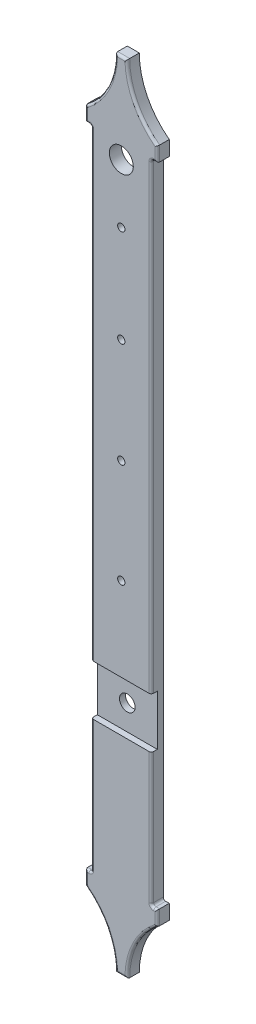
ISO-10303-21;
HEADER;
FILE_DESCRIPTION(('STEP AP214'),'2;1');
FILE_NAME('part.step','',(''),(''),'','','');
FILE_SCHEMA(('AUTOMOTIVE_DESIGN { 1 0 10303 214 1 1 1 1 }'));
ENDSEC;
DATA;
#1=APPLICATION_CONTEXT('core data for automotive mechanical design processes');
#2=APPLICATION_PROTOCOL_DEFINITION('international standard','automotive_design',2000,#1);
#3=PRODUCT_CONTEXT('',#1,'mechanical');
#4=PRODUCT('Part','Part','',(#3));
#5=PRODUCT_RELATED_PRODUCT_CATEGORY('part','',(#4));
#6=PRODUCT_DEFINITION_FORMATION('','',#4);
#7=PRODUCT_DEFINITION_CONTEXT('part definition',#1,'design');
#8=PRODUCT_DEFINITION('design','',#6,#7);
#9=PRODUCT_DEFINITION_SHAPE('','',#8);
#10=(LENGTH_UNIT() NAMED_UNIT(*) SI_UNIT(.MILLI.,.METRE.));
#11=(NAMED_UNIT(*) PLANE_ANGLE_UNIT() SI_UNIT($,.RADIAN.));
#12=(NAMED_UNIT(*) SI_UNIT($,.STERADIAN.) SOLID_ANGLE_UNIT());
#13=UNCERTAINTY_MEASURE_WITH_UNIT(LENGTH_MEASURE(1.E-05),#10,'distance_accuracy_value','');
#14=(GEOMETRIC_REPRESENTATION_CONTEXT(3) GLOBAL_UNCERTAINTY_ASSIGNED_CONTEXT((#13)) GLOBAL_UNIT_ASSIGNED_CONTEXT((#10,
#11,#12)) REPRESENTATION_CONTEXT('',''));
#15=CARTESIAN_POINT('',(0.,0.,0.));
#16=DIRECTION('',(0.,0.,1.));
#17=DIRECTION('',(1.,0.,0.));
#18=AXIS2_PLACEMENT_3D('',#15,#16,#17);
#19=CARTESIAN_POINT('',(67.5099995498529,331.992498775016,10.));
#20=DIRECTION('',(0.,0.,1.));
#21=DIRECTION('',(1.,0.,0.));
#22=AXIS2_PLACEMENT_3D('',#19,#20,#21);
#23=PLANE('',#22);
#24=DIRECTION('',(1.,0.,0.));
#25=VECTOR('',#24,1.);
#26=CARTESIAN_POINT('',(25.0000000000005,-158.5,10.));
#27=LINE('',#26,#25);
#28=CARTESIAN_POINT('',(-23.,-158.5,10.));
#29=VERTEX_POINT('',#28);
#30=CARTESIAN_POINT('',(23.0000000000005,-158.5,10.));
#31=VERTEX_POINT('',#30);
#32=EDGE_CURVE('E284',#29,#31,#27,.T.);
#33=ORIENTED_EDGE('',*,*,#32,.F.);
#34=DIRECTION('',(0.,-1.,0.));
#35=VECTOR('',#34,1.);
#36=CARTESIAN_POINT('',(-23.,-267.7,10.));
#37=LINE('',#36,#35);
#38=CARTESIAN_POINT('',(-23.,-267.7,10.));
#39=VERTEX_POINT('',#38);
#40=EDGE_CURVE('E422',#29,#39,#37,.T.);
#41=ORIENTED_EDGE('',*,*,#40,.T.);
#42=CARTESIAN_POINT('',(-27.,-267.7,10.));
#43=DIRECTION('',(0.,0.,1.));
#44=DIRECTION('',(1.,0.,0.));
#45=AXIS2_PLACEMENT_3D('',#42,#43,#44);
#46=CIRCLE('',#45,4.);
#47=CARTESIAN_POINT('',(-27.,-271.7,10.));
#48=VERTEX_POINT('',#47);
#49=EDGE_CURVE('E438',#39,#48,#46,.F.);
#50=ORIENTED_EDGE('',*,*,#49,.T.);
#51=DIRECTION('',(-1.,0.,0.));
#52=VECTOR('',#51,1.);
#53=CARTESIAN_POINT('',(-30.,-271.7,10.));
#54=LINE('',#53,#52);
#55=CARTESIAN_POINT('',(-28.,-271.7,10.));
#56=VERTEX_POINT('',#55);
#57=EDGE_CURVE('E440',#48,#56,#54,.T.);
#58=ORIENTED_EDGE('',*,*,#57,.T.);
#59=DIRECTION('',(0.,-1.,0.));
#60=VECTOR('',#59,1.);
#61=CARTESIAN_POINT('',(-28.,-282.,10.));
#62=LINE('',#61,#60);
#63=CARTESIAN_POINT('',(-28.,-281.010051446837,10.));
#64=VERTEX_POINT('',#63);
#65=EDGE_CURVE('E442',#56,#64,#62,.T.);
#66=ORIENTED_EDGE('',*,*,#65,.T.);
#67=CARTESIAN_POINT('',(-67.509999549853,-331.992498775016,10.));
#68=DIRECTION('',(0.,0.,1.));
#69=DIRECTION('',(1.,0.,0.));
#70=AXIS2_PLACEMENT_3D('',#67,#68,#69);
#71=CIRCLE('',#70,64.5);
#72=CARTESIAN_POINT('',(-3.04078248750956,-330.,10.));
#73=VERTEX_POINT('',#72);
#74=EDGE_CURVE('E444',#64,#73,#71,.F.);
#75=ORIENTED_EDGE('',*,*,#74,.T.);
#76=DIRECTION('',(1.,0.,0.));
#77=VECTOR('',#76,1.);
#78=CARTESIAN_POINT('',(5.00999999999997,-330.,10.));
#79=LINE('',#78,#77);
#80=CARTESIAN_POINT('',(3.04078248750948,-330.,10.));
#81=VERTEX_POINT('',#80);
#82=EDGE_CURVE('E446',#73,#81,#79,.T.);
#83=ORIENTED_EDGE('',*,*,#82,.T.);
#84=CARTESIAN_POINT('',(67.5099995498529,-331.992498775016,10.));
#85=DIRECTION('',(0.,0.,1.));
#86=DIRECTION('',(1.,0.,0.));
#87=AXIS2_PLACEMENT_3D('',#84,#85,#86);
#88=CIRCLE('',#87,64.5);
#89=CARTESIAN_POINT('',(28.,-281.010051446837,10.));
#90=VERTEX_POINT('',#89);
#91=EDGE_CURVE('E448',#81,#90,#88,.F.);
#92=ORIENTED_EDGE('',*,*,#91,.T.);
#93=DIRECTION('',(0.,1.,0.));
#94=VECTOR('',#93,1.);
#95=CARTESIAN_POINT('',(28.,-269.7,10.));
#96=LINE('',#95,#94);
#97=CARTESIAN_POINT('',(28.,-271.7,10.));
#98=VERTEX_POINT('',#97);
#99=EDGE_CURVE('E450',#90,#98,#96,.T.);
#100=ORIENTED_EDGE('',*,*,#99,.T.);
#101=DIRECTION('',(-1.,0.,0.));
#102=VECTOR('',#101,1.);
#103=CARTESIAN_POINT('',(27.0000000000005,-271.7,10.));
#104=LINE('',#103,#102);
#105=CARTESIAN_POINT('',(27.0000000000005,-271.7,10.));
#106=VERTEX_POINT('',#105);
#107=EDGE_CURVE('E453',#98,#106,#104,.T.);
#108=ORIENTED_EDGE('',*,*,#107,.T.);
#109=CARTESIAN_POINT('',(27.0000000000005,-267.7,10.));
#110=DIRECTION('',(0.,0.,1.));
#111=DIRECTION('',(1.,0.,0.));
#112=AXIS2_PLACEMENT_3D('',#109,#110,#111);
#113=CIRCLE('',#112,4.);
#114=CARTESIAN_POINT('',(23.0000000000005,-267.7,10.));
#115=VERTEX_POINT('',#114);
#116=EDGE_CURVE('E455',#106,#115,#113,.F.);
#117=ORIENTED_EDGE('',*,*,#116,.T.);
#118=DIRECTION('',(0.,1.,0.));
#119=VECTOR('',#118,1.);
#120=CARTESIAN_POINT('',(23.0000000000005,267.7,10.));
#121=LINE('',#120,#119);
#122=EDGE_CURVE('E458',#115,#31,#121,.T.);
#123=ORIENTED_EDGE('',*,*,#122,.T.);
#124=EDGE_LOOP('',(#33,#41,#50,#58,#66,#75,#83,#92,#100,#108,#117,#123));
#125=FACE_BOUND('',#124,.T.);
#126=ADVANCED_FACE('F34',(#125),#23,.T.);
#127=CARTESIAN_POINT('',(-23.,331.992498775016,8.));
#128=DIRECTION('',(0.,1.,0.));
#129=DIRECTION('',(0.,0.,1.));
#130=AXIS2_PLACEMENT_3D('',#127,#128,#129);
#131=CYLINDRICAL_SURFACE('',#130,2.);
#132=CARTESIAN_POINT('',(-23.,-158.5,8.));
#133=DIRECTION('',(0.,-1.,0.));
#134=DIRECTION('',(0.,0.,-1.));
#135=AXIS2_PLACEMENT_3D('',#132,#133,#134);
#136=CIRCLE('',#135,2.);
#137=CARTESIAN_POINT('',(-25.,-158.5,8.));
#138=VERTEX_POINT('',#137);
#139=EDGE_CURVE('E299',#138,#29,#136,.F.);
#140=ORIENTED_EDGE('',*,*,#139,.F.);
#141=DIRECTION('',(0.,-1.,0.));
#142=VECTOR('',#141,1.);
#143=CARTESIAN_POINT('',(-25.,267.7,8.));
#144=LINE('',#143,#142);
#145=CARTESIAN_POINT('',(-25.,-267.7,8.));
#146=VERTEX_POINT('',#145);
#147=EDGE_CURVE('E516',#146,#138,#144,.F.);
#148=ORIENTED_EDGE('',*,*,#147,.F.);
#149=CARTESIAN_POINT('',(-23.,-267.7,8.));
#150=DIRECTION('',(0.,-1.,0.));
#151=DIRECTION('',(0.,0.,-1.));
#152=AXIS2_PLACEMENT_3D('',#149,#150,#151);
#153=CIRCLE('',#152,2.);
#154=EDGE_CURVE('E616',#39,#146,#153,.T.);
#155=ORIENTED_EDGE('',*,*,#154,.F.);
#156=ORIENTED_EDGE('',*,*,#40,.F.);
#157=EDGE_LOOP('',(#140,#148,#155,#156));
#158=FACE_BOUND('',#157,.T.);
#159=ADVANCED_FACE('F675',(#158),#131,.T.);
#160=CARTESIAN_POINT('',(23.0000000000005,331.992498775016,8.));
#161=DIRECTION('',(0.,-1.,0.));
#162=DIRECTION('',(0.,0.,-1.));
#163=AXIS2_PLACEMENT_3D('',#160,#161,#162);
#164=CYLINDRICAL_SURFACE('',#163,2.);
#165=CARTESIAN_POINT('',(23.0000000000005,-158.5,8.));
#166=DIRECTION('',(0.,-1.,0.));
#167=DIRECTION('',(0.,0.,-1.));
#168=AXIS2_PLACEMENT_3D('',#165,#166,#167);
#169=CIRCLE('',#168,2.);
#170=CARTESIAN_POINT('',(25.0000000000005,-158.5,8.));
#171=VERTEX_POINT('',#170);
#172=EDGE_CURVE('E11',#31,#171,#169,.F.);
#173=ORIENTED_EDGE('',*,*,#172,.F.);
#174=ORIENTED_EDGE('',*,*,#122,.F.);
#175=CARTESIAN_POINT('',(23.0000000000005,-267.7,8.));
#176=DIRECTION('',(0.,-1.,0.));
#177=DIRECTION('',(0.,0.,-1.));
#178=AXIS2_PLACEMENT_3D('',#175,#176,#177);
#179=CIRCLE('',#178,2.);
#180=CARTESIAN_POINT('',(25.0000000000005,-267.7,8.));
#181=VERTEX_POINT('',#180);
#182=EDGE_CURVE('E565',#181,#115,#179,.T.);
#183=ORIENTED_EDGE('',*,*,#182,.F.);
#184=DIRECTION('',(0.,1.,0.));
#185=VECTOR('',#184,1.);
#186=CARTESIAN_POINT('',(25.0000000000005,-267.7,8.));
#187=LINE('',#186,#185);
#188=EDGE_CURVE('E510',#171,#181,#187,.F.);
#189=ORIENTED_EDGE('',*,*,#188,.F.);
#190=EDGE_LOOP('',(#173,#174,#183,#189));
#191=FACE_BOUND('',#190,.T.);
#192=ADVANCED_FACE('F682',(#191),#164,.T.);
#193=CARTESIAN_POINT('',(30.,-269.7,10.));
#194=DIRECTION('',(0.,-1.,0.));
#195=DIRECTION('',(0.,0.,-1.));
#196=AXIS2_PLACEMENT_3D('',#193,#194,#195);
#197=PLANE('',#196);
#198=DIRECTION('',(0.,0.,-1.));
#199=VECTOR('',#198,1.);
#200=CARTESIAN_POINT('',(27.0000000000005,-269.7,10.));
#201=LINE('',#200,#199);
#202=CARTESIAN_POINT('',(27.0000000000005,-269.7,0.));
#203=VERTEX_POINT('',#202);
#204=CARTESIAN_POINT('',(27.0000000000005,-269.7,8.));
#205=VERTEX_POINT('',#204);
#206=EDGE_CURVE('E407',#203,#205,#201,.F.);
#207=ORIENTED_EDGE('',*,*,#206,.T.);
#208=DIRECTION('',(-1.,0.,0.));
#209=VECTOR('',#208,1.);
#210=CARTESIAN_POINT('',(30.,-269.7,8.));
#211=LINE('',#210,#209);
#212=CARTESIAN_POINT('',(30.,-269.7,8.));
#213=VERTEX_POINT('',#212);
#214=EDGE_CURVE('E513',#205,#213,#211,.F.);
#215=ORIENTED_EDGE('',*,*,#214,.T.);
#216=DIRECTION('',(0.,0.,-1.));
#217=VECTOR('',#216,1.);
#218=CARTESIAN_POINT('',(30.,-269.7,10.));
#219=LINE('',#218,#217);
#220=CARTESIAN_POINT('',(30.,-269.7,0.));
#221=VERTEX_POINT('',#220);
#222=EDGE_CURVE('E372',#213,#221,#219,.T.);
#223=ORIENTED_EDGE('',*,*,#222,.T.);
#224=DIRECTION('',(-1.,0.,0.));
#225=VECTOR('',#224,1.);
#226=CARTESIAN_POINT('',(30.,-269.7,0.));
#227=LINE('',#226,#225);
#228=EDGE_CURVE('E324',#221,#203,#227,.T.);
#229=ORIENTED_EDGE('',*,*,#228,.T.);
#230=EDGE_LOOP('',(#207,#215,#223,#229));
#231=FACE_BOUND('',#230,.T.);
#232=ADVANCED_FACE('F728',(#231),#197,.F.);
#233=CARTESIAN_POINT('',(25.0000000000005,-269.7,10.));
#234=DIRECTION('',(-1.,0.,0.));
#235=DIRECTION('',(0.,0.,1.));
#236=AXIS2_PLACEMENT_3D('',#233,#234,#235);
#237=PLANE('',#236);
#238=DIRECTION('',(0.,1.,0.));
#239=VECTOR('',#238,1.);
#240=CARTESIAN_POINT('',(25.0000000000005,-116.5,5.));
#241=LINE('',#240,#239);
#242=CARTESIAN_POINT('',(25.0000000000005,-158.5,5.));
#243=VERTEX_POINT('',#242);
#244=CARTESIAN_POINT('',(25.0000000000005,-116.5,5.));
#245=VERTEX_POINT('',#244);
#246=EDGE_CURVE('E274',#243,#245,#241,.T.);
#247=ORIENTED_EDGE('',*,*,#246,.F.);
#248=DIRECTION('',(0.,0.,1.));
#249=VECTOR('',#248,1.);
#250=CARTESIAN_POINT('',(25.0000000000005,-158.5,5.));
#251=LINE('',#250,#249);
#252=EDGE_CURVE('E748',#243,#171,#251,.T.);
#253=ORIENTED_EDGE('',*,*,#252,.T.);
#254=ORIENTED_EDGE('',*,*,#188,.T.);
#255=DIRECTION('',(0.,0.,-1.));
#256=VECTOR('',#255,1.);
#257=CARTESIAN_POINT('',(25.0000000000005,-267.7,0.));
#258=LINE('',#257,#256);
#259=CARTESIAN_POINT('',(25.0000000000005,-267.7,0.));
#260=VERTEX_POINT('',#259);
#261=EDGE_CURVE('E405',#181,#260,#258,.T.);
#262=ORIENTED_EDGE('',*,*,#261,.T.);
#263=DIRECTION('',(0.,1.,0.));
#264=VECTOR('',#263,1.);
#265=CARTESIAN_POINT('',(25.0000000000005,-269.7,0.));
#266=LINE('',#265,#264);
#267=CARTESIAN_POINT('',(25.0000000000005,267.7,0.));
#268=VERTEX_POINT('',#267);
#269=EDGE_CURVE('E327',#260,#268,#266,.T.);
#270=ORIENTED_EDGE('',*,*,#269,.T.);
#271=DIRECTION('',(0.,0.,-1.));
#272=VECTOR('',#271,1.);
#273=CARTESIAN_POINT('',(25.0000000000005,267.7,10.));
#274=LINE('',#273,#272);
#275=CARTESIAN_POINT('',(25.0000000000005,267.7,8.));
#276=VERTEX_POINT('',#275);
#277=EDGE_CURVE('E403',#268,#276,#274,.F.);
#278=ORIENTED_EDGE('',*,*,#277,.T.);
#279=CARTESIAN_POINT('',(25.0000000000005,-116.5,8.));
#280=VERTEX_POINT('',#279);
#281=EDGE_CURVE('E290',#276,#280,#187,.F.);
#282=ORIENTED_EDGE('',*,*,#281,.T.);
#283=DIRECTION('',(0.,0.,1.));
#284=VECTOR('',#283,1.);
#285=CARTESIAN_POINT('',(25.0000000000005,-116.5,5.));
#286=LINE('',#285,#284);
#287=EDGE_CURVE('E49',#245,#280,#286,.T.);
#288=ORIENTED_EDGE('',*,*,#287,.F.);
#289=EDGE_LOOP('',(#247,#253,#254,#262,#270,#278,#282,#288));
#290=FACE_BOUND('',#289,.T.);
#291=ADVANCED_FACE('F287',(#290),#237,.F.);
#292=CARTESIAN_POINT('',(30.,269.7,10.));
#293=DIRECTION('',(0.,1.,0.));
#294=DIRECTION('',(0.,0.,1.));
#295=AXIS2_PLACEMENT_3D('',#292,#293,#294);
#296=PLANE('',#295);
#297=DIRECTION('',(0.,0.,-1.));
#298=VECTOR('',#297,1.);
#299=CARTESIAN_POINT('',(30.,269.7,10.));
#300=LINE('',#299,#298);
#301=CARTESIAN_POINT('',(30.,269.7,8.));
#302=VERTEX_POINT('',#301);
#303=CARTESIAN_POINT('',(30.,269.7,0.));
#304=VERTEX_POINT('',#303);
#305=EDGE_CURVE('E394',#302,#304,#300,.T.);
#306=ORIENTED_EDGE('',*,*,#305,.F.);
#307=DIRECTION('',(1.,0.,0.));
#308=VECTOR('',#307,1.);
#309=CARTESIAN_POINT('',(27.0000000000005,269.7,8.));
#310=LINE('',#309,#308);
#311=CARTESIAN_POINT('',(27.0000000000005,269.7,8.));
#312=VERTEX_POINT('',#311);
#313=EDGE_CURVE('E506',#302,#312,#310,.F.);
#314=ORIENTED_EDGE('',*,*,#313,.T.);
#315=DIRECTION('',(0.,0.,-1.));
#316=VECTOR('',#315,1.);
#317=CARTESIAN_POINT('',(27.0000000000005,269.7,0.));
#318=LINE('',#317,#316);
#319=CARTESIAN_POINT('',(27.0000000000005,269.7,0.));
#320=VERTEX_POINT('',#319);
#321=EDGE_CURVE('E409',#312,#320,#318,.T.);
#322=ORIENTED_EDGE('',*,*,#321,.T.);
#323=DIRECTION('',(1.,0.,0.));
#324=VECTOR('',#323,1.);
#325=CARTESIAN_POINT('',(30.,269.7,0.));
#326=LINE('',#325,#324);
#327=EDGE_CURVE('E330',#320,#304,#326,.T.);
#328=ORIENTED_EDGE('',*,*,#327,.T.);
#329=EDGE_LOOP('',(#306,#314,#322,#328));
#330=FACE_BOUND('',#329,.T.);
#331=ADVANCED_FACE('F810',(#330),#296,.F.);
#332=CARTESIAN_POINT('',(30.,269.7,10.));
#333=DIRECTION('',(-1.,0.,0.));
#334=DIRECTION('',(0.,0.,1.));
#335=AXIS2_PLACEMENT_3D('',#332,#333,#334);
#336=PLANE('',#335);
#337=DIRECTION('',(0.,0.,-1.));
#338=VECTOR('',#337,1.);
#339=CARTESIAN_POINT('',(30.,282.,10.));
#340=LINE('',#339,#338);
#341=CARTESIAN_POINT('',(30.,282.,8.));
#342=VERTEX_POINT('',#341);
#343=CARTESIAN_POINT('',(30.,282.,0.));
#344=VERTEX_POINT('',#343);
#345=EDGE_CURVE('E392',#342,#344,#340,.T.);
#346=ORIENTED_EDGE('',*,*,#345,.F.);
#347=DIRECTION('',(0.,1.,0.));
#348=VECTOR('',#347,1.);
#349=CARTESIAN_POINT('',(30.,269.7,8.));
#350=LINE('',#349,#348);
#351=EDGE_CURVE('E504',#342,#302,#350,.F.);
#352=ORIENTED_EDGE('',*,*,#351,.T.);
#353=ORIENTED_EDGE('',*,*,#305,.T.);
#354=DIRECTION('',(0.,1.,0.));
#355=VECTOR('',#354,1.);
#356=CARTESIAN_POINT('',(30.,269.7,0.));
#357=LINE('',#356,#355);
#358=EDGE_CURVE('E333',#304,#344,#357,.T.);
#359=ORIENTED_EDGE('',*,*,#358,.T.);
#360=EDGE_LOOP('',(#346,#352,#353,#359));
#361=FACE_BOUND('',#360,.T.);
#362=ADVANCED_FACE('F815',(#361),#336,.F.);
#363=CARTESIAN_POINT('',(67.5099995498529,331.992498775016,10.));
#364=DIRECTION('',(0.,0.,-1.));
#365=DIRECTION('',(-1.,0.,0.));
#366=AXIS2_PLACEMENT_3D('',#363,#364,#365);
#367=CYLINDRICAL_SURFACE('',#366,62.5);
#368=DIRECTION('',(0.,0.,-1.));
#369=VECTOR('',#368,1.);
#370=CARTESIAN_POINT('',(5.00999999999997,332.,10.));
#371=LINE('',#370,#369);
#372=CARTESIAN_POINT('',(5.00999999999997,332.,8.));
#373=VERTEX_POINT('',#372);
#374=CARTESIAN_POINT('',(5.00999999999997,332.,0.));
#375=VERTEX_POINT('',#374);
#376=EDGE_CURVE('E390',#373,#375,#371,.T.);
#377=ORIENTED_EDGE('',*,*,#376,.F.);
#378=CARTESIAN_POINT('',(67.5099995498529,331.992498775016,8.));
#379=DIRECTION('',(0.,0.,1.));
#380=DIRECTION('',(1.,0.,0.));
#381=AXIS2_PLACEMENT_3D('',#378,#379,#380);
#382=CIRCLE('',#381,62.5);
#383=EDGE_CURVE('E502',#373,#342,#382,.T.);
#384=ORIENTED_EDGE('',*,*,#383,.T.);
#385=ORIENTED_EDGE('',*,*,#345,.T.);
#386=CARTESIAN_POINT('',(67.5099995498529,331.992498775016,0.));
#387=DIRECTION('',(0.,0.,-1.));
#388=DIRECTION('',(1.,0.,0.));
#389=AXIS2_PLACEMENT_3D('',#386,#387,#388);
#390=CIRCLE('',#389,62.5);
#391=EDGE_CURVE('E336',#344,#375,#390,.T.);
#392=ORIENTED_EDGE('',*,*,#391,.T.);
#393=EDGE_LOOP('',(#377,#384,#385,#392));
#394=FACE_BOUND('',#393,.T.);
#395=ADVANCED_FACE('F825',(#394),#367,.F.);
#396=CARTESIAN_POINT('',(-5.01000000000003,332.,10.));
#397=DIRECTION('',(0.,-1.,0.));
#398=DIRECTION('',(0.,0.,-1.));
#399=AXIS2_PLACEMENT_3D('',#396,#397,#398);
#400=PLANE('',#399);
#401=DIRECTION('',(0.,0.,-1.));
#402=VECTOR('',#401,1.);
#403=CARTESIAN_POINT('',(-5.01000000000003,332.,10.));
#404=LINE('',#403,#402);
#405=CARTESIAN_POINT('',(-5.01000000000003,332.,8.));
#406=VERTEX_POINT('',#405);
#407=CARTESIAN_POINT('',(-5.01000000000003,332.,0.));
#408=VERTEX_POINT('',#407);
#409=EDGE_CURVE('E388',#406,#408,#404,.T.);
#410=ORIENTED_EDGE('',*,*,#409,.F.);
#411=DIRECTION('',(-1.,0.,0.));
#412=VECTOR('',#411,1.);
#413=CARTESIAN_POINT('',(5.00999999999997,332.,8.));
#414=LINE('',#413,#412);
#415=EDGE_CURVE('E500',#406,#373,#414,.F.);
#416=ORIENTED_EDGE('',*,*,#415,.T.);
#417=ORIENTED_EDGE('',*,*,#376,.T.);
#418=DIRECTION('',(-1.,0.,0.));
#419=VECTOR('',#418,1.);
#420=CARTESIAN_POINT('',(-5.01000000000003,332.,0.));
#421=LINE('',#420,#419);
#422=EDGE_CURVE('E339',#375,#408,#421,.T.);
#423=ORIENTED_EDGE('',*,*,#422,.T.);
#424=EDGE_LOOP('',(#410,#416,#417,#423));
#425=FACE_BOUND('',#424,.T.);
#426=ADVANCED_FACE('F835',(#425),#400,.F.);
#427=CARTESIAN_POINT('',(-67.509999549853,331.992498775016,10.));
#428=DIRECTION('',(0.,0.,-1.));
#429=DIRECTION('',(-1.,0.,0.));
#430=AXIS2_PLACEMENT_3D('',#427,#428,#429);
#431=CYLINDRICAL_SURFACE('',#430,62.5);
#432=DIRECTION('',(0.,0.,-1.));
#433=VECTOR('',#432,1.);
#434=CARTESIAN_POINT('',(-30.,282.,10.));
#435=LINE('',#434,#433);
#436=CARTESIAN_POINT('',(-30.,282.,8.));
#437=VERTEX_POINT('',#436);
#438=CARTESIAN_POINT('',(-30.,282.,0.));
#439=VERTEX_POINT('',#438);
#440=EDGE_CURVE('E386',#437,#439,#435,.T.);
#441=ORIENTED_EDGE('',*,*,#440,.F.);
#442=CARTESIAN_POINT('',(-67.509999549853,331.992498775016,8.));
#443=DIRECTION('',(0.,0.,1.));
#444=DIRECTION('',(1.,0.,0.));
#445=AXIS2_PLACEMENT_3D('',#442,#443,#444);
#446=CIRCLE('',#445,62.5);
#447=EDGE_CURVE('E498',#437,#406,#446,.T.);
#448=ORIENTED_EDGE('',*,*,#447,.T.);
#449=ORIENTED_EDGE('',*,*,#409,.T.);
#450=CARTESIAN_POINT('',(-67.509999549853,331.992498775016,0.));
#451=DIRECTION('',(0.,0.,-1.));
#452=DIRECTION('',(-1.,0.,0.));
#453=AXIS2_PLACEMENT_3D('',#450,#451,#452);
#454=CIRCLE('',#453,62.5);
#455=EDGE_CURVE('E342',#408,#439,#454,.T.);
#456=ORIENTED_EDGE('',*,*,#455,.T.);
#457=EDGE_LOOP('',(#441,#448,#449,#456));
#458=FACE_BOUND('',#457,.T.);
#459=ADVANCED_FACE('F845',(#458),#431,.F.);
#460=CARTESIAN_POINT('',(-30.,269.7,10.));
#461=DIRECTION('',(1.,0.,0.));
#462=DIRECTION('',(0.,0.,-1.));
#463=AXIS2_PLACEMENT_3D('',#460,#461,#462);
#464=PLANE('',#463);
#465=DIRECTION('',(0.,0.,-1.));
#466=VECTOR('',#465,1.);
#467=CARTESIAN_POINT('',(-30.,269.7,10.));
#468=LINE('',#467,#466);
#469=CARTESIAN_POINT('',(-30.,269.7,8.));
#470=VERTEX_POINT('',#469);
#471=CARTESIAN_POINT('',(-30.,269.7,0.));
#472=VERTEX_POINT('',#471);
#473=EDGE_CURVE('E384',#470,#472,#468,.T.);
#474=ORIENTED_EDGE('',*,*,#473,.F.);
#475=DIRECTION('',(0.,-1.,0.));
#476=VECTOR('',#475,1.);
#477=CARTESIAN_POINT('',(-30.,282.,8.));
#478=LINE('',#477,#476);
#479=EDGE_CURVE('E496',#470,#437,#478,.F.);
#480=ORIENTED_EDGE('',*,*,#479,.T.);
#481=ORIENTED_EDGE('',*,*,#440,.T.);
#482=DIRECTION('',(0.,-1.,0.));
#483=VECTOR('',#482,1.);
#484=CARTESIAN_POINT('',(-30.,269.7,0.));
#485=LINE('',#484,#483);
#486=EDGE_CURVE('E345',#439,#472,#485,.T.);
#487=ORIENTED_EDGE('',*,*,#486,.T.);
#488=EDGE_LOOP('',(#474,#480,#481,#487));
#489=FACE_BOUND('',#488,.T.);
#490=ADVANCED_FACE('F855',(#489),#464,.F.);
#491=CARTESIAN_POINT('',(-25.,269.7,10.));
#492=DIRECTION('',(0.,1.,0.));
#493=DIRECTION('',(0.,0.,1.));
#494=AXIS2_PLACEMENT_3D('',#491,#492,#493);
#495=PLANE('',#494);
#496=DIRECTION('',(0.,0.,-1.));
#497=VECTOR('',#496,1.);
#498=CARTESIAN_POINT('',(-27.,269.7,10.));
#499=LINE('',#498,#497);
#500=CARTESIAN_POINT('',(-27.,269.7,0.));
#501=VERTEX_POINT('',#500);
#502=CARTESIAN_POINT('',(-27.,269.7,8.));
#503=VERTEX_POINT('',#502);
#504=EDGE_CURVE('E411',#501,#503,#499,.F.);
#505=ORIENTED_EDGE('',*,*,#504,.T.);
#506=DIRECTION('',(1.,0.,0.));
#507=VECTOR('',#506,1.);
#508=CARTESIAN_POINT('',(-30.,269.7,8.));
#509=LINE('',#508,#507);
#510=EDGE_CURVE('E494',#503,#470,#509,.F.);
#511=ORIENTED_EDGE('',*,*,#510,.T.);
#512=ORIENTED_EDGE('',*,*,#473,.T.);
#513=DIRECTION('',(1.,0.,0.));
#514=VECTOR('',#513,1.);
#515=CARTESIAN_POINT('',(-25.,269.7,0.));
#516=LINE('',#515,#514);
#517=EDGE_CURVE('E348',#472,#501,#516,.T.);
#518=ORIENTED_EDGE('',*,*,#517,.T.);
#519=EDGE_LOOP('',(#505,#511,#512,#518));
#520=FACE_BOUND('',#519,.T.);
#521=ADVANCED_FACE('F865',(#520),#495,.F.);
#522=CARTESIAN_POINT('',(-25.,-269.7,10.));
#523=DIRECTION('',(1.,0.,0.));
#524=DIRECTION('',(0.,0.,-1.));
#525=AXIS2_PLACEMENT_3D('',#522,#523,#524);
#526=PLANE('',#525);
#527=ORIENTED_EDGE('',*,*,#147,.T.);
#528=DIRECTION('',(0.,0.,1.));
#529=VECTOR('',#528,1.);
#530=CARTESIAN_POINT('',(-25.,-158.5,5.));
#531=LINE('',#530,#529);
#532=CARTESIAN_POINT('',(-25.,-158.5,5.));
#533=VERTEX_POINT('',#532);
#534=EDGE_CURVE('E292',#533,#138,#531,.T.);
#535=ORIENTED_EDGE('',*,*,#534,.F.);
#536=DIRECTION('',(0.,-1.,0.));
#537=VECTOR('',#536,1.);
#538=CARTESIAN_POINT('',(-25.,-158.5,5.));
#539=LINE('',#538,#537);
#540=CARTESIAN_POINT('',(-25.,-116.5,5.));
#541=VERTEX_POINT('',#540);
#542=EDGE_CURVE('E273',#541,#533,#539,.T.);
#543=ORIENTED_EDGE('',*,*,#542,.F.);
#544=DIRECTION('',(0.,0.,1.));
#545=VECTOR('',#544,1.);
#546=CARTESIAN_POINT('',(-25.,-116.5,5.));
#547=LINE('',#546,#545);
#548=CARTESIAN_POINT('',(-25.,-116.5,8.));
#549=VERTEX_POINT('',#548);
#550=EDGE_CURVE('E270',#541,#549,#547,.T.);
#551=ORIENTED_EDGE('',*,*,#550,.T.);
#552=CARTESIAN_POINT('',(-25.,267.7,8.));
#553=VERTEX_POINT('',#552);
#554=EDGE_CURVE('E515',#549,#553,#144,.F.);
#555=ORIENTED_EDGE('',*,*,#554,.T.);
#556=DIRECTION('',(0.,0.,-1.));
#557=VECTOR('',#556,1.);
#558=CARTESIAN_POINT('',(-25.,267.7,0.));
#559=LINE('',#558,#557);
#560=CARTESIAN_POINT('',(-25.,267.7,0.));
#561=VERTEX_POINT('',#560);
#562=EDGE_CURVE('E398',#553,#561,#559,.T.);
#563=ORIENTED_EDGE('',*,*,#562,.T.);
#564=DIRECTION('',(0.,-1.,0.));
#565=VECTOR('',#564,1.);
#566=CARTESIAN_POINT('',(-25.,-269.7,0.));
#567=LINE('',#566,#565);
#568=CARTESIAN_POINT('',(-25.,-267.7,0.));
#569=VERTEX_POINT('',#568);
#570=EDGE_CURVE('E351',#561,#569,#567,.T.);
#571=ORIENTED_EDGE('',*,*,#570,.T.);
#572=DIRECTION('',(0.,0.,-1.));
#573=VECTOR('',#572,1.);
#574=CARTESIAN_POINT('',(-25.,-267.7,10.));
#575=LINE('',#574,#573);
#576=EDGE_CURVE('E400',#569,#146,#575,.F.);
#577=ORIENTED_EDGE('',*,*,#576,.T.);
#578=EDGE_LOOP('',(#527,#535,#543,#551,#555,#563,#571,#577));
#579=FACE_BOUND('',#578,.T.);
#580=ADVANCED_FACE('F875',(#579),#526,.F.);
#581=CARTESIAN_POINT('',(-25.,-269.7,10.));
#582=DIRECTION('',(0.,-1.,0.));
#583=DIRECTION('',(0.,0.,-1.));
#584=AXIS2_PLACEMENT_3D('',#581,#582,#583);
#585=PLANE('',#584);
#586=DIRECTION('',(0.,0.,-1.));
#587=VECTOR('',#586,1.);
#588=CARTESIAN_POINT('',(-30.,-269.7,10.));
#589=LINE('',#588,#587);
#590=CARTESIAN_POINT('',(-30.,-269.7,8.));
#591=VERTEX_POINT('',#590);
#592=CARTESIAN_POINT('',(-30.,-269.7,0.));
#593=VERTEX_POINT('',#592);
#594=EDGE_CURVE('E382',#591,#593,#589,.T.);
#595=ORIENTED_EDGE('',*,*,#594,.F.);
#596=DIRECTION('',(-1.,0.,0.));
#597=VECTOR('',#596,1.);
#598=CARTESIAN_POINT('',(-27.,-269.7,8.));
#599=LINE('',#598,#597);
#600=CARTESIAN_POINT('',(-27.,-269.7,8.));
#601=VERTEX_POINT('',#600);
#602=EDGE_CURVE('E488',#591,#601,#599,.F.);
#603=ORIENTED_EDGE('',*,*,#602,.T.);
#604=DIRECTION('',(0.,0.,-1.));
#605=VECTOR('',#604,1.);
#606=CARTESIAN_POINT('',(-27.,-269.7,0.));
#607=LINE('',#606,#605);
#608=CARTESIAN_POINT('',(-27.,-269.7,0.));
#609=VERTEX_POINT('',#608);
#610=EDGE_CURVE('E396',#601,#609,#607,.T.);
#611=ORIENTED_EDGE('',*,*,#610,.T.);
#612=DIRECTION('',(-1.,0.,0.));
#613=VECTOR('',#612,1.);
#614=CARTESIAN_POINT('',(-25.,-269.7,0.));
#615=LINE('',#614,#613);
#616=EDGE_CURVE('E354',#609,#593,#615,.T.);
#617=ORIENTED_EDGE('',*,*,#616,.T.);
#618=EDGE_LOOP('',(#595,#603,#611,#617));
#619=FACE_BOUND('',#618,.T.);
#620=ADVANCED_FACE('F883',(#619),#585,.F.);
#621=CARTESIAN_POINT('',(-30.,-269.7,10.));
#622=DIRECTION('',(1.,0.,0.));
#623=DIRECTION('',(0.,0.,-1.));
#624=AXIS2_PLACEMENT_3D('',#621,#622,#623);
#625=PLANE('',#624);
#626=DIRECTION('',(0.,0.,-1.));
#627=VECTOR('',#626,1.);
#628=CARTESIAN_POINT('',(-30.,-282.,10.));
#629=LINE('',#628,#627);
#630=CARTESIAN_POINT('',(-30.,-282.,8.));
#631=VERTEX_POINT('',#630);
#632=CARTESIAN_POINT('',(-30.,-282.,0.));
#633=VERTEX_POINT('',#632);
#634=EDGE_CURVE('E380',#631,#633,#629,.T.);
#635=ORIENTED_EDGE('',*,*,#634,.F.);
#636=DIRECTION('',(0.,-1.,0.));
#637=VECTOR('',#636,1.);
#638=CARTESIAN_POINT('',(-30.,-269.7,8.));
#639=LINE('',#638,#637);
#640=EDGE_CURVE('E486',#631,#591,#639,.F.);
#641=ORIENTED_EDGE('',*,*,#640,.T.);
#642=ORIENTED_EDGE('',*,*,#594,.T.);
#643=DIRECTION('',(0.,-1.,0.));
#644=VECTOR('',#643,1.);
#645=CARTESIAN_POINT('',(-30.,-269.7,0.));
#646=LINE('',#645,#644);
#647=EDGE_CURVE('E357',#593,#633,#646,.T.);
#648=ORIENTED_EDGE('',*,*,#647,.T.);
#649=EDGE_LOOP('',(#635,#641,#642,#648));
#650=FACE_BOUND('',#649,.T.);
#651=ADVANCED_FACE('F888',(#650),#625,.F.);
#652=CARTESIAN_POINT('',(-67.509999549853,-331.992498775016,10.));
#653=DIRECTION('',(0.,0.,-1.));
#654=DIRECTION('',(-1.,0.,0.));
#655=AXIS2_PLACEMENT_3D('',#652,#653,#654);
#656=CYLINDRICAL_SURFACE('',#655,62.5);
#657=DIRECTION('',(0.,0.,-1.));
#658=VECTOR('',#657,1.);
#659=CARTESIAN_POINT('',(-5.01000000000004,-332.,10.));
#660=LINE('',#659,#658);
#661=CARTESIAN_POINT('',(-5.01000000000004,-332.,8.));
#662=VERTEX_POINT('',#661);
#663=CARTESIAN_POINT('',(-5.01000000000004,-332.,0.));
#664=VERTEX_POINT('',#663);
#665=EDGE_CURVE('E378',#662,#664,#660,.T.);
#666=ORIENTED_EDGE('',*,*,#665,.F.);
#667=CARTESIAN_POINT('',(-67.509999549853,-331.992498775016,8.));
#668=DIRECTION('',(0.,0.,1.));
#669=DIRECTION('',(1.,0.,0.));
#670=AXIS2_PLACEMENT_3D('',#667,#668,#669);
#671=CIRCLE('',#670,62.5);
#672=EDGE_CURVE('E484',#662,#631,#671,.T.);
#673=ORIENTED_EDGE('',*,*,#672,.T.);
#674=ORIENTED_EDGE('',*,*,#634,.T.);
#675=CARTESIAN_POINT('',(-67.509999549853,-331.992498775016,0.));
#676=DIRECTION('',(0.,0.,-1.));
#677=DIRECTION('',(1.,0.,0.));
#678=AXIS2_PLACEMENT_3D('',#675,#676,#677);
#679=CIRCLE('',#678,62.5);
#680=EDGE_CURVE('E360',#633,#664,#679,.T.);
#681=ORIENTED_EDGE('',*,*,#680,.T.);
#682=EDGE_LOOP('',(#666,#673,#674,#681));
#683=FACE_BOUND('',#682,.T.);
#684=ADVANCED_FACE('F898',(#683),#656,.F.);
#685=CARTESIAN_POINT('',(-5.01000000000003,-332.,10.));
#686=DIRECTION('',(0.,1.,0.));
#687=DIRECTION('',(0.,0.,1.));
#688=AXIS2_PLACEMENT_3D('',#685,#686,#687);
#689=PLANE('',#688);
#690=DIRECTION('',(0.,0.,-1.));
#691=VECTOR('',#690,1.);
#692=CARTESIAN_POINT('',(5.00999999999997,-332.,10.));
#693=LINE('',#692,#691);
#694=CARTESIAN_POINT('',(5.00999999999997,-332.,8.));
#695=VERTEX_POINT('',#694);
#696=CARTESIAN_POINT('',(5.00999999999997,-332.,0.));
#697=VERTEX_POINT('',#696);
#698=EDGE_CURVE('E376',#695,#697,#693,.T.);
#699=ORIENTED_EDGE('',*,*,#698,.F.);
#700=DIRECTION('',(1.,0.,0.));
#701=VECTOR('',#700,1.);
#702=CARTESIAN_POINT('',(-5.01000000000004,-332.,8.));
#703=LINE('',#702,#701);
#704=EDGE_CURVE('E482',#695,#662,#703,.F.);
#705=ORIENTED_EDGE('',*,*,#704,.T.);
#706=ORIENTED_EDGE('',*,*,#665,.T.);
#707=DIRECTION('',(1.,0.,0.));
#708=VECTOR('',#707,1.);
#709=CARTESIAN_POINT('',(-5.01000000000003,-332.,0.));
#710=LINE('',#709,#708);
#711=EDGE_CURVE('E363',#664,#697,#710,.T.);
#712=ORIENTED_EDGE('',*,*,#711,.T.);
#713=EDGE_LOOP('',(#699,#705,#706,#712));
#714=FACE_BOUND('',#713,.T.);
#715=ADVANCED_FACE('F908',(#714),#689,.F.);
#716=CARTESIAN_POINT('',(67.5099995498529,-331.992498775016,10.));
#717=DIRECTION('',(0.,0.,-1.));
#718=DIRECTION('',(-1.,0.,0.));
#719=AXIS2_PLACEMENT_3D('',#716,#717,#718);
#720=CYLINDRICAL_SURFACE('',#719,62.5);
#721=DIRECTION('',(0.,0.,-1.));
#722=VECTOR('',#721,1.);
#723=CARTESIAN_POINT('',(30.,-282.,10.));
#724=LINE('',#723,#722);
#725=CARTESIAN_POINT('',(30.,-282.,8.));
#726=VERTEX_POINT('',#725);
#727=CARTESIAN_POINT('',(30.,-282.,0.));
#728=VERTEX_POINT('',#727);
#729=EDGE_CURVE('E374',#726,#728,#724,.T.);
#730=ORIENTED_EDGE('',*,*,#729,.F.);
#731=CARTESIAN_POINT('',(67.5099995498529,-331.992498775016,8.));
#732=DIRECTION('',(0.,0.,1.));
#733=DIRECTION('',(1.,0.,0.));
#734=AXIS2_PLACEMENT_3D('',#731,#732,#733);
#735=CIRCLE('',#734,62.5);
#736=EDGE_CURVE('E480',#726,#695,#735,.T.);
#737=ORIENTED_EDGE('',*,*,#736,.T.);
#738=ORIENTED_EDGE('',*,*,#698,.T.);
#739=CARTESIAN_POINT('',(67.5099995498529,-331.992498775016,0.));
#740=DIRECTION('',(0.,0.,-1.));
#741=DIRECTION('',(-1.,0.,0.));
#742=AXIS2_PLACEMENT_3D('',#739,#740,#741);
#743=CIRCLE('',#742,62.5);
#744=EDGE_CURVE('E366',#697,#728,#743,.T.);
#745=ORIENTED_EDGE('',*,*,#744,.T.);
#746=EDGE_LOOP('',(#730,#737,#738,#745));
#747=FACE_BOUND('',#746,.T.);
#748=ADVANCED_FACE('F697',(#747),#720,.F.);
#749=CARTESIAN_POINT('',(30.,-269.7,10.));
#750=DIRECTION('',(-1.,0.,0.));
#751=DIRECTION('',(0.,0.,1.));
#752=AXIS2_PLACEMENT_3D('',#749,#750,#751);
#753=PLANE('',#752);
#754=ORIENTED_EDGE('',*,*,#222,.F.);
#755=DIRECTION('',(0.,1.,0.));
#756=VECTOR('',#755,1.);
#757=CARTESIAN_POINT('',(30.,-282.,8.));
#758=LINE('',#757,#756);
#759=EDGE_CURVE('E477',#213,#726,#758,.F.);
#760=ORIENTED_EDGE('',*,*,#759,.T.);
#761=ORIENTED_EDGE('',*,*,#729,.T.);
#762=DIRECTION('',(0.,1.,0.));
#763=VECTOR('',#762,1.);
#764=CARTESIAN_POINT('',(30.,-269.7,0.));
#765=LINE('',#764,#763);
#766=EDGE_CURVE('E369',#728,#221,#765,.T.);
#767=ORIENTED_EDGE('',*,*,#766,.T.);
#768=EDGE_LOOP('',(#754,#760,#761,#767));
#769=FACE_BOUND('',#768,.T.);
#770=ADVANCED_FACE('F689',(#769),#753,.F.);
#771=DIRECTION('',(-1.,0.,0.));
#772=VECTOR('',#771,1.);
#773=CARTESIAN_POINT('',(25.0000000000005,-116.5,10.));
#774=LINE('',#773,#772);
#775=CARTESIAN_POINT('',(23.0000000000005,-116.5,10.));
#776=VERTEX_POINT('',#775);
#777=CARTESIAN_POINT('',(-23.,-116.5,10.));
#778=VERTEX_POINT('',#777);
#779=EDGE_CURVE('E702',#776,#778,#774,.T.);
#780=ORIENTED_EDGE('',*,*,#779,.F.);
#781=CARTESIAN_POINT('',(23.0000000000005,267.7,10.));
#782=VERTEX_POINT('',#781);
#783=EDGE_CURVE('E457',#776,#782,#121,.T.);
#784=ORIENTED_EDGE('',*,*,#783,.T.);
#785=CARTESIAN_POINT('',(27.0000000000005,267.7,10.));
#786=DIRECTION('',(0.,0.,1.));
#787=DIRECTION('',(1.,0.,0.));
#788=AXIS2_PLACEMENT_3D('',#785,#786,#787);
#789=CIRCLE('',#788,4.);
#790=CARTESIAN_POINT('',(27.0000000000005,271.7,10.));
#791=VERTEX_POINT('',#790);
#792=EDGE_CURVE('E461',#782,#791,#789,.F.);
#793=ORIENTED_EDGE('',*,*,#792,.T.);
#794=DIRECTION('',(1.,0.,0.));
#795=VECTOR('',#794,1.);
#796=CARTESIAN_POINT('',(30.,271.7,10.));
#797=LINE('',#796,#795);
#798=CARTESIAN_POINT('',(28.,271.7,10.));
#799=VERTEX_POINT('',#798);
#800=EDGE_CURVE('E463',#791,#799,#797,.T.);
#801=ORIENTED_EDGE('',*,*,#800,.T.);
#802=DIRECTION('',(0.,1.,0.));
#803=VECTOR('',#802,1.);
#804=CARTESIAN_POINT('',(28.,282.,10.));
#805=LINE('',#804,#803);
#806=CARTESIAN_POINT('',(28.,281.010051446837,10.));
#807=VERTEX_POINT('',#806);
#808=EDGE_CURVE('E465',#799,#807,#805,.T.);
#809=ORIENTED_EDGE('',*,*,#808,.T.);
#810=CARTESIAN_POINT('',(67.5099995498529,331.992498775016,10.));
#811=DIRECTION('',(0.,0.,1.));
#812=DIRECTION('',(1.,0.,0.));
#813=AXIS2_PLACEMENT_3D('',#810,#811,#812);
#814=CIRCLE('',#813,64.5);
#815=CARTESIAN_POINT('',(3.04078248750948,330.,10.));
#816=VERTEX_POINT('',#815);
#817=EDGE_CURVE('E467',#807,#816,#814,.F.);
#818=ORIENTED_EDGE('',*,*,#817,.T.);
#819=DIRECTION('',(-1.,0.,0.));
#820=VECTOR('',#819,1.);
#821=CARTESIAN_POINT('',(-5.01000000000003,330.,10.));
#822=LINE('',#821,#820);
#823=CARTESIAN_POINT('',(-3.04078248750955,330.,10.));
#824=VERTEX_POINT('',#823);
#825=EDGE_CURVE('E469',#816,#824,#822,.T.);
#826=ORIENTED_EDGE('',*,*,#825,.T.);
#827=CARTESIAN_POINT('',(-67.509999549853,331.992498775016,10.));
#828=DIRECTION('',(0.,0.,1.));
#829=DIRECTION('',(1.,0.,0.));
#830=AXIS2_PLACEMENT_3D('',#827,#828,#829);
#831=CIRCLE('',#830,64.5);
#832=CARTESIAN_POINT('',(-28.,281.010051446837,10.));
#833=VERTEX_POINT('',#832);
#834=EDGE_CURVE('E471',#824,#833,#831,.F.);
#835=ORIENTED_EDGE('',*,*,#834,.T.);
#836=DIRECTION('',(0.,-1.,0.));
#837=VECTOR('',#836,1.);
#838=CARTESIAN_POINT('',(-28.,269.7,10.));
#839=LINE('',#838,#837);
#840=CARTESIAN_POINT('',(-28.,271.7,10.));
#841=VERTEX_POINT('',#840);
#842=EDGE_CURVE('E473',#833,#841,#839,.T.);
#843=ORIENTED_EDGE('',*,*,#842,.T.);
#844=DIRECTION('',(1.,0.,0.));
#845=VECTOR('',#844,1.);
#846=CARTESIAN_POINT('',(-27.,271.7,10.));
#847=LINE('',#846,#845);
#848=CARTESIAN_POINT('',(-27.,271.7,10.));
#849=VERTEX_POINT('',#848);
#850=EDGE_CURVE('E475',#841,#849,#847,.T.);
#851=ORIENTED_EDGE('',*,*,#850,.T.);
#852=CARTESIAN_POINT('',(-27.,267.7,10.));
#853=DIRECTION('',(0.,0.,1.));
#854=DIRECTION('',(1.,0.,0.));
#855=AXIS2_PLACEMENT_3D('',#852,#853,#854);
#856=CIRCLE('',#855,4.);
#857=CARTESIAN_POINT('',(-23.,267.7,10.));
#858=VERTEX_POINT('',#857);
#859=EDGE_CURVE('E436',#849,#858,#856,.F.);
#860=ORIENTED_EDGE('',*,*,#859,.T.);
#861=EDGE_CURVE('E433',#858,#778,#37,.T.);
#862=ORIENTED_EDGE('',*,*,#861,.T.);
#863=EDGE_LOOP('',(#780,#784,#793,#801,#809,#818,#826,#835,#843,#851,#860,#862));
#864=FACE_BOUND('',#863,.T.);
#865=CARTESIAN_POINT('',(0.,-46.68,10.));
#866=DIRECTION('',(0.,0.,1.));
#867=DIRECTION('',(1.,0.,0.));
#868=AXIS2_PLACEMENT_3D('',#865,#866,#867);
#869=CIRCLE('',#868,3.05);
#870=CARTESIAN_POINT('',(3.05,-46.68,10.));
#871=VERTEX_POINT('',#870);
#872=EDGE_CURVE('E303',#871,#871,#869,.T.);
#873=ORIENTED_EDGE('',*,*,#872,.F.);
#874=EDGE_LOOP('',(#873));
#875=FACE_BOUND('',#874,.T.);
#876=CARTESIAN_POINT('',(0.,40.,10.));
#877=DIRECTION('',(0.,0.,1.));
#878=DIRECTION('',(1.,0.,0.));
#879=AXIS2_PLACEMENT_3D('',#876,#877,#878);
#880=CIRCLE('',#879,3.05);
#881=CARTESIAN_POINT('',(3.05,40.,10.));
#882=VERTEX_POINT('',#881);
#883=EDGE_CURVE('E308',#882,#882,#880,.T.);
#884=ORIENTED_EDGE('',*,*,#883,.F.);
#885=EDGE_LOOP('',(#884));
#886=FACE_BOUND('',#885,.T.);
#887=CARTESIAN_POINT('',(0.,127.4,10.));
#888=DIRECTION('',(0.,0.,1.));
#889=DIRECTION('',(1.,0.,0.));
#890=AXIS2_PLACEMENT_3D('',#887,#888,#889);
#891=CIRCLE('',#890,3.05);
#892=CARTESIAN_POINT('',(3.05,127.4,10.));
#893=VERTEX_POINT('',#892);
#894=EDGE_CURVE('E312',#893,#893,#891,.T.);
#895=ORIENTED_EDGE('',*,*,#894,.F.);
#896=EDGE_LOOP('',(#895));
#897=FACE_BOUND('',#896,.T.);
#898=CARTESIAN_POINT('',(0.,208.4,10.));
#899=DIRECTION('',(0.,0.,1.));
#900=DIRECTION('',(1.,0.,0.));
#901=AXIS2_PLACEMENT_3D('',#898,#899,#900);
#902=CIRCLE('',#901,3.05);
#903=CARTESIAN_POINT('',(3.05,208.4,10.));
#904=VERTEX_POINT('',#903);
#905=EDGE_CURVE('E316',#904,#904,#902,.T.);
#906=ORIENTED_EDGE('',*,*,#905,.F.);
#907=EDGE_LOOP('',(#906));
#908=FACE_BOUND('',#907,.T.);
#909=CARTESIAN_POINT('',(0.,257.4,10.));
#910=DIRECTION('',(0.,0.,1.));
#911=DIRECTION('',(1.,0.,0.));
#912=AXIS2_PLACEMENT_3D('',#909,#910,#911);
#913=CIRCLE('',#912,10.);
#914=CARTESIAN_POINT('',(10.,257.4,10.));
#915=VERTEX_POINT('',#914);
#916=EDGE_CURVE('E320',#915,#915,#913,.T.);
#917=ORIENTED_EDGE('',*,*,#916,.F.);
#918=EDGE_LOOP('',(#917));
#919=FACE_BOUND('',#918,.T.);
#920=ADVANCED_FACE('F678',(#864,#875,#886,#897,#908,#919),#23,.T.);
#921=CARTESIAN_POINT('',(67.5099995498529,331.992498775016,0.));
#922=DIRECTION('',(0.,0.,1.));
#923=DIRECTION('',(1.,0.,0.));
#924=AXIS2_PLACEMENT_3D('',#921,#922,#923);
#925=PLANE('',#924);
#926=CARTESIAN_POINT('',(0.,-137.5,0.));
#927=DIRECTION('',(0.,0.,1.));
#928=DIRECTION('',(1.,0.,0.));
#929=AXIS2_PLACEMENT_3D('',#926,#927,#928);
#930=CIRCLE('',#929,6.5);
#931=CARTESIAN_POINT('',(6.5,-137.5,0.));
#932=VERTEX_POINT('',#931);
#933=EDGE_CURVE('E302',#932,#932,#930,.T.);
#934=ORIENTED_EDGE('',*,*,#933,.T.);
#935=EDGE_LOOP('',(#934));
#936=FACE_BOUND('',#935,.T.);
#937=CARTESIAN_POINT('',(0.,-46.68,0.));
#938=DIRECTION('',(0.,0.,1.));
#939=DIRECTION('',(1.,0.,0.));
#940=AXIS2_PLACEMENT_3D('',#937,#938,#939);
#941=CIRCLE('',#940,3.05);
#942=CARTESIAN_POINT('',(3.05,-46.68,0.));
#943=VERTEX_POINT('',#942);
#944=EDGE_CURVE('E306',#943,#943,#941,.T.);
#945=ORIENTED_EDGE('',*,*,#944,.T.);
#946=EDGE_LOOP('',(#945));
#947=FACE_BOUND('',#946,.T.);
#948=CARTESIAN_POINT('',(0.,40.,0.));
#949=DIRECTION('',(0.,0.,1.));
#950=DIRECTION('',(1.,0.,0.));
#951=AXIS2_PLACEMENT_3D('',#948,#949,#950);
#952=CIRCLE('',#951,3.05);
#953=CARTESIAN_POINT('',(3.05,40.,0.));
#954=VERTEX_POINT('',#953);
#955=EDGE_CURVE('E311',#954,#954,#952,.T.);
#956=ORIENTED_EDGE('',*,*,#955,.T.);
#957=EDGE_LOOP('',(#956));
#958=FACE_BOUND('',#957,.T.);
#959=CARTESIAN_POINT('',(0.,127.4,0.));
#960=DIRECTION('',(0.,0.,1.));
#961=DIRECTION('',(1.,0.,0.));
#962=AXIS2_PLACEMENT_3D('',#959,#960,#961);
#963=CIRCLE('',#962,3.05);
#964=CARTESIAN_POINT('',(3.05,127.4,0.));
#965=VERTEX_POINT('',#964);
#966=EDGE_CURVE('E315',#965,#965,#963,.T.);
#967=ORIENTED_EDGE('',*,*,#966,.T.);
#968=EDGE_LOOP('',(#967));
#969=FACE_BOUND('',#968,.T.);
#970=CARTESIAN_POINT('',(0.,208.4,0.));
#971=DIRECTION('',(0.,0.,1.));
#972=DIRECTION('',(1.,0.,0.));
#973=AXIS2_PLACEMENT_3D('',#970,#971,#972);
#974=CIRCLE('',#973,3.05);
#975=CARTESIAN_POINT('',(3.05,208.4,0.));
#976=VERTEX_POINT('',#975);
#977=EDGE_CURVE('E319',#976,#976,#974,.T.);
#978=ORIENTED_EDGE('',*,*,#977,.T.);
#979=EDGE_LOOP('',(#978));
#980=FACE_BOUND('',#979,.T.);
#981=CARTESIAN_POINT('',(0.,257.4,0.));
#982=DIRECTION('',(0.,0.,1.));
#983=DIRECTION('',(1.,0.,0.));
#984=AXIS2_PLACEMENT_3D('',#981,#982,#983);
#985=CIRCLE('',#984,10.);
#986=CARTESIAN_POINT('',(10.,257.4,0.));
#987=VERTEX_POINT('',#986);
#988=EDGE_CURVE('E323',#987,#987,#985,.T.);
#989=ORIENTED_EDGE('',*,*,#988,.T.);
#990=EDGE_LOOP('',(#989));
#991=FACE_BOUND('',#990,.T.);
#992=ORIENTED_EDGE('',*,*,#228,.F.);
#993=ORIENTED_EDGE('',*,*,#766,.F.);
#994=ORIENTED_EDGE('',*,*,#744,.F.);
#995=ORIENTED_EDGE('',*,*,#711,.F.);
#996=ORIENTED_EDGE('',*,*,#680,.F.);
#997=ORIENTED_EDGE('',*,*,#647,.F.);
#998=ORIENTED_EDGE('',*,*,#616,.F.);
#999=CARTESIAN_POINT('',(-27.,-267.7,0.));
#1000=DIRECTION('',(0.,0.,1.));
#1001=DIRECTION('',(1.,0.,0.));
#1002=AXIS2_PLACEMENT_3D('',#999,#1000,#1001);
#1003=CIRCLE('',#1002,2.);
#1004=EDGE_CURVE('E414',#609,#569,#1003,.T.);
#1005=ORIENTED_EDGE('',*,*,#1004,.T.);
#1006=ORIENTED_EDGE('',*,*,#570,.F.);
#1007=CARTESIAN_POINT('',(-27.,267.7,0.));
#1008=DIRECTION('',(0.,0.,1.));
#1009=DIRECTION('',(1.,0.,0.));
#1010=AXIS2_PLACEMENT_3D('',#1007,#1008,#1009);
#1011=CIRCLE('',#1010,2.);
#1012=EDGE_CURVE('E420',#561,#501,#1011,.T.);
#1013=ORIENTED_EDGE('',*,*,#1012,.T.);
#1014=ORIENTED_EDGE('',*,*,#517,.F.);
#1015=ORIENTED_EDGE('',*,*,#486,.F.);
#1016=ORIENTED_EDGE('',*,*,#455,.F.);
#1017=ORIENTED_EDGE('',*,*,#422,.F.);
#1018=ORIENTED_EDGE('',*,*,#391,.F.);
#1019=ORIENTED_EDGE('',*,*,#358,.F.);
#1020=ORIENTED_EDGE('',*,*,#327,.F.);
#1021=CARTESIAN_POINT('',(27.0000000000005,267.7,0.));
#1022=DIRECTION('',(0.,0.,1.));
#1023=DIRECTION('',(1.,0.,0.));
#1024=AXIS2_PLACEMENT_3D('',#1021,#1022,#1023);
#1025=CIRCLE('',#1024,2.);
#1026=EDGE_CURVE('E418',#320,#268,#1025,.T.);
#1027=ORIENTED_EDGE('',*,*,#1026,.T.);
#1028=ORIENTED_EDGE('',*,*,#269,.F.);
#1029=CARTESIAN_POINT('',(27.0000000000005,-267.7,0.));
#1030=DIRECTION('',(0.,0.,1.));
#1031=DIRECTION('',(1.,0.,0.));
#1032=AXIS2_PLACEMENT_3D('',#1029,#1030,#1031);
#1033=CIRCLE('',#1032,2.);
#1034=EDGE_CURVE('E416',#260,#203,#1033,.T.);
#1035=ORIENTED_EDGE('',*,*,#1034,.T.);
#1036=EDGE_LOOP('',(#992,#993,#994,#995,#996,#997,#998,#1005,#1006,#1013,#1014,#1015,#1016,
#1017,#1018,#1019,#1020,#1027,#1028,#1035));
#1037=FACE_BOUND('',#1036,.T.);
#1038=ADVANCED_FACE('F688',(#936,#947,#958,#969,#980,#991,#1037),#925,.F.);
#1039=CARTESIAN_POINT('',(-27.,-267.7,10.));
#1040=DIRECTION('',(0.,0.,1.));
#1041=DIRECTION('',(1.,0.,0.));
#1042=AXIS2_PLACEMENT_3D('',#1039,#1040,#1041);
#1043=CYLINDRICAL_SURFACE('',#1042,2.);
#1044=ORIENTED_EDGE('',*,*,#610,.F.);
#1045=CARTESIAN_POINT('',(-27.,-267.7,8.));
#1046=DIRECTION('',(0.,0.,1.));
#1047=DIRECTION('',(1.,0.,0.));
#1048=AXIS2_PLACEMENT_3D('',#1045,#1046,#1047);
#1049=CIRCLE('',#1048,2.);
#1050=EDGE_CURVE('E490',#601,#146,#1049,.T.);
#1051=ORIENTED_EDGE('',*,*,#1050,.T.);
#1052=ORIENTED_EDGE('',*,*,#576,.F.);
#1053=ORIENTED_EDGE('',*,*,#1004,.F.);
#1054=EDGE_LOOP('',(#1044,#1051,#1052,#1053));
#1055=FACE_BOUND('',#1054,.T.);
#1056=ADVANCED_FACE('F695',(#1055),#1043,.F.);
#1057=CARTESIAN_POINT('',(27.0000000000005,-267.7,10.));
#1058=DIRECTION('',(0.,0.,1.));
#1059=DIRECTION('',(1.,0.,0.));
#1060=AXIS2_PLACEMENT_3D('',#1057,#1058,#1059);
#1061=CYLINDRICAL_SURFACE('',#1060,2.);
#1062=ORIENTED_EDGE('',*,*,#261,.F.);
#1063=CARTESIAN_POINT('',(27.0000000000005,-267.7,8.));
#1064=DIRECTION('',(0.,0.,1.));
#1065=DIRECTION('',(1.,0.,0.));
#1066=AXIS2_PLACEMENT_3D('',#1063,#1064,#1065);
#1067=CIRCLE('',#1066,2.);
#1068=EDGE_CURVE('E57',#181,#205,#1067,.T.);
#1069=ORIENTED_EDGE('',*,*,#1068,.T.);
#1070=ORIENTED_EDGE('',*,*,#206,.F.);
#1071=ORIENTED_EDGE('',*,*,#1034,.F.);
#1072=EDGE_LOOP('',(#1062,#1069,#1070,#1071));
#1073=FACE_BOUND('',#1072,.T.);
#1074=ADVANCED_FACE('F731',(#1073),#1061,.F.);
#1075=CARTESIAN_POINT('',(27.0000000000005,267.7,10.));
#1076=DIRECTION('',(0.,0.,1.));
#1077=DIRECTION('',(1.,0.,0.));
#1078=AXIS2_PLACEMENT_3D('',#1075,#1076,#1077);
#1079=CYLINDRICAL_SURFACE('',#1078,2.);
#1080=ORIENTED_EDGE('',*,*,#321,.F.);
#1081=CARTESIAN_POINT('',(27.0000000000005,267.7,8.));
#1082=DIRECTION('',(0.,0.,1.));
#1083=DIRECTION('',(1.,0.,0.));
#1084=AXIS2_PLACEMENT_3D('',#1081,#1082,#1083);
#1085=CIRCLE('',#1084,2.);
#1086=EDGE_CURVE('E508',#312,#276,#1085,.T.);
#1087=ORIENTED_EDGE('',*,*,#1086,.T.);
#1088=ORIENTED_EDGE('',*,*,#277,.F.);
#1089=ORIENTED_EDGE('',*,*,#1026,.F.);
#1090=EDGE_LOOP('',(#1080,#1087,#1088,#1089));
#1091=FACE_BOUND('',#1090,.T.);
#1092=ADVANCED_FACE('F739',(#1091),#1079,.F.);
#1093=CARTESIAN_POINT('',(-27.,267.7,10.));
#1094=DIRECTION('',(0.,0.,1.));
#1095=DIRECTION('',(1.,0.,0.));
#1096=AXIS2_PLACEMENT_3D('',#1093,#1094,#1095);
#1097=CYLINDRICAL_SURFACE('',#1096,2.);
#1098=ORIENTED_EDGE('',*,*,#562,.F.);
#1099=CARTESIAN_POINT('',(-27.,267.7,8.));
#1100=DIRECTION('',(0.,0.,1.));
#1101=DIRECTION('',(1.,0.,0.));
#1102=AXIS2_PLACEMENT_3D('',#1099,#1100,#1101);
#1103=CIRCLE('',#1102,2.);
#1104=EDGE_CURVE('E492',#553,#503,#1103,.T.);
#1105=ORIENTED_EDGE('',*,*,#1104,.T.);
#1106=ORIENTED_EDGE('',*,*,#504,.F.);
#1107=ORIENTED_EDGE('',*,*,#1012,.F.);
#1108=EDGE_LOOP('',(#1098,#1105,#1106,#1107));
#1109=FACE_BOUND('',#1108,.T.);
#1110=ADVANCED_FACE('F718',(#1109),#1097,.F.);
#1111=CARTESIAN_POINT('',(0.,257.4,-45.3));
#1112=DIRECTION('',(0.,0.,1.));
#1113=DIRECTION('',(1.,0.,0.));
#1114=AXIS2_PLACEMENT_3D('',#1111,#1112,#1113);
#1115=CYLINDRICAL_SURFACE('',#1114,10.);
#1116=ORIENTED_EDGE('',*,*,#916,.T.);
#1117=EDGE_LOOP('',(#1116));
#1118=FACE_BOUND('',#1117,.T.);
#1119=ORIENTED_EDGE('',*,*,#988,.F.);
#1120=EDGE_LOOP('',(#1119));
#1121=FACE_BOUND('',#1120,.T.);
#1122=ADVANCED_FACE('F714',(#1118,#1121),#1115,.F.);
#1123=CARTESIAN_POINT('',(0.,208.4,-45.3));
#1124=DIRECTION('',(0.,0.,1.));
#1125=DIRECTION('',(1.,0.,0.));
#1126=AXIS2_PLACEMENT_3D('',#1123,#1124,#1125);
#1127=CYLINDRICAL_SURFACE('',#1126,3.05);
#1128=ORIENTED_EDGE('',*,*,#905,.T.);
#1129=EDGE_LOOP('',(#1128));
#1130=FACE_BOUND('',#1129,.T.);
#1131=ORIENTED_EDGE('',*,*,#977,.F.);
#1132=EDGE_LOOP('',(#1131));
#1133=FACE_BOUND('',#1132,.T.);
#1134=ADVANCED_FACE('F717',(#1130,#1133),#1127,.F.);
#1135=CARTESIAN_POINT('',(0.,127.4,-45.3));
#1136=DIRECTION('',(0.,0.,1.));
#1137=DIRECTION('',(1.,0.,0.));
#1138=AXIS2_PLACEMENT_3D('',#1135,#1136,#1137);
#1139=CYLINDRICAL_SURFACE('',#1138,3.05);
#1140=ORIENTED_EDGE('',*,*,#894,.T.);
#1141=EDGE_LOOP('',(#1140));
#1142=FACE_BOUND('',#1141,.T.);
#1143=ORIENTED_EDGE('',*,*,#966,.F.);
#1144=EDGE_LOOP('',(#1143));
#1145=FACE_BOUND('',#1144,.T.);
#1146=ADVANCED_FACE('F766',(#1142,#1145),#1139,.F.);
#1147=CARTESIAN_POINT('',(0.,40.,-45.3));
#1148=DIRECTION('',(0.,0.,1.));
#1149=DIRECTION('',(1.,0.,0.));
#1150=AXIS2_PLACEMENT_3D('',#1147,#1148,#1149);
#1151=CYLINDRICAL_SURFACE('',#1150,3.05);
#1152=ORIENTED_EDGE('',*,*,#883,.T.);
#1153=EDGE_LOOP('',(#1152));
#1154=FACE_BOUND('',#1153,.T.);
#1155=ORIENTED_EDGE('',*,*,#955,.F.);
#1156=EDGE_LOOP('',(#1155));
#1157=FACE_BOUND('',#1156,.T.);
#1158=ADVANCED_FACE('F670',(#1154,#1157),#1151,.F.);
#1159=CARTESIAN_POINT('',(0.,-46.68,-45.3));
#1160=DIRECTION('',(0.,0.,1.));
#1161=DIRECTION('',(1.,0.,0.));
#1162=AXIS2_PLACEMENT_3D('',#1159,#1160,#1161);
#1163=CYLINDRICAL_SURFACE('',#1162,3.05);
#1164=ORIENTED_EDGE('',*,*,#872,.T.);
#1165=EDGE_LOOP('',(#1164));
#1166=FACE_BOUND('',#1165,.T.);
#1167=ORIENTED_EDGE('',*,*,#944,.F.);
#1168=EDGE_LOOP('',(#1167));
#1169=FACE_BOUND('',#1168,.T.);
#1170=ADVANCED_FACE('F663',(#1166,#1169),#1163,.F.);
#1171=CARTESIAN_POINT('',(-28.,331.992498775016,8.));
#1172=DIRECTION('',(0.,1.,0.));
#1173=DIRECTION('',(0.,0.,1.));
#1174=AXIS2_PLACEMENT_3D('',#1171,#1172,#1173);
#1175=CYLINDRICAL_SURFACE('',#1174,2.);
#1176=CARTESIAN_POINT('',(-30.,282.,8.));
#1177=CARTESIAN_POINT('',(-30.0000081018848,282.000004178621,8.05201580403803));
#1178=CARTESIAN_POINT('',(-29.9979709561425,281.998985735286,8.10402712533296));
#1179=CARTESIAN_POINT('',(-29.9898683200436,281.994935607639,8.20764243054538));
#1180=CARTESIAN_POINT('',(-29.9838039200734,281.991904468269,8.25924652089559));
#1181=CARTESIAN_POINT('',(-29.9677372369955,281.983875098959,8.36149699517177));
#1182=CARTESIAN_POINT('',(-29.9577489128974,281.978883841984,8.41214611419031));
#1183=CARTESIAN_POINT('',(-29.9339601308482,281.966998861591,8.51230005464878));
#1184=CARTESIAN_POINT('',(-29.9201595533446,281.96010507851,8.5618048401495));
#1185=CARTESIAN_POINT('',(-29.8732697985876,281.93668836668,8.70802946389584));
#1186=CARTESIAN_POINT('',(-29.8346676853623,281.91741761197,8.80261513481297));
#1187=CARTESIAN_POINT('',(-29.7443643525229,281.872372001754,8.98359025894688));
#1188=CARTESIAN_POINT('',(-29.6926550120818,281.846593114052,9.06997458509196));
#1189=CARTESIAN_POINT('',(-29.5755380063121,281.788261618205,9.2363063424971));
#1190=CARTESIAN_POINT('',(-29.5096418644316,281.755467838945,9.31582462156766));
#1191=CARTESIAN_POINT('',(-29.3677857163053,281.684952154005,9.46273805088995));
#1192=CARTESIAN_POINT('',(-29.2918227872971,281.647228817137,9.53012966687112));
#1193=CARTESIAN_POINT('',(-29.1239294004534,281.56395683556,9.65801114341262));
#1194=CARTESIAN_POINT('',(-29.0311618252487,281.518002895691,9.71713707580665));
#1195=CARTESIAN_POINT('',(-28.8385595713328,281.422735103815,9.81898253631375));
#1196=CARTESIAN_POINT('',(-28.7387197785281,281.373418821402,9.86169004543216));
#1197=CARTESIAN_POINT('',(-28.5349469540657,281.272918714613,9.93011338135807));
#1198=CARTESIAN_POINT('',(-28.4310348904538,281.221744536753,9.95590655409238));
#1199=CARTESIAN_POINT('',(-28.2210608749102,281.118497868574,9.99058191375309));
#1200=CARTESIAN_POINT('',(-28.1150040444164,281.066427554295,9.99950046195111));
#1201=CARTESIAN_POINT('',(-28.0060222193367,281.013003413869,9.999993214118));
#1202=CARTESIAN_POINT('',(-28.0030110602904,281.011527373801,10.0000000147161));
#1203=CARTESIAN_POINT('',(-28.,281.010051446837,10.));
#1204=B_SPLINE_CURVE_WITH_KNOTS('',3,(#1176,#1177,#1178,#1179,#1180,#1181,#1182,#1183,#1184,
#1185,#1186,#1187,#1188,#1189,#1190,#1191,#1192,#1193,#1194,#1195,#1196,#1197,#1198,#1199,#1200,
#1201,#1202,#1203),.UNSPECIFIED.,.F.,.F.,(4,2,2,2,2,2,2,2,2,2,2,2,2,4),(0.,0.15598999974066,
0.311937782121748,0.467335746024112,0.622738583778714,0.933076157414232,1.24360647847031,
1.56732425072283,1.89113621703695,2.24732678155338,2.60377759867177,2.95858685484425,
3.31263069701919,3.32269110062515),.UNSPECIFIED.);
#1205=EDGE_CURVE('E653',#437,#833,#1204,.T.);
#1206=ORIENTED_EDGE('',*,*,#1205,.F.);
#1207=ORIENTED_EDGE('',*,*,#479,.F.);
#1208=CARTESIAN_POINT('',(-28.,271.7,8.));
#1209=DIRECTION('',(-0.707106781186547,0.707106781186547,0.));
#1210=DIRECTION('',(0.707106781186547,0.707106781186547,0.));
#1211=AXIS2_PLACEMENT_3D('',#1208,#1209,#1210);
#1212=ELLIPSE('',#1211,2.82842712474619,2.);
#1213=EDGE_CURVE('E307',#841,#470,#1212,.F.);
#1214=ORIENTED_EDGE('',*,*,#1213,.F.);
#1215=ORIENTED_EDGE('',*,*,#842,.F.);
#1216=EDGE_LOOP('',(#1206,#1207,#1214,#1215));
#1217=FACE_BOUND('',#1216,.T.);
#1218=ADVANCED_FACE('F660',(#1217),#1175,.T.);
#1219=CARTESIAN_POINT('',(67.5099995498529,271.7,8.));
#1220=DIRECTION('',(-1.,0.,0.));
#1221=DIRECTION('',(0.,0.,1.));
#1222=AXIS2_PLACEMENT_3D('',#1219,#1220,#1221);
#1223=CYLINDRICAL_SURFACE('',#1222,2.);
#1224=ORIENTED_EDGE('',*,*,#1213,.T.);
#1225=ORIENTED_EDGE('',*,*,#510,.F.);
#1226=CARTESIAN_POINT('',(-27.,271.7,8.));
#1227=DIRECTION('',(1.,0.,0.));
#1228=DIRECTION('',(0.,0.,-1.));
#1229=AXIS2_PLACEMENT_3D('',#1226,#1227,#1228);
#1230=CIRCLE('',#1229,2.);
#1231=EDGE_CURVE('E645',#849,#503,#1230,.T.);
#1232=ORIENTED_EDGE('',*,*,#1231,.F.);
#1233=ORIENTED_EDGE('',*,*,#850,.F.);
#1234=EDGE_LOOP('',(#1224,#1225,#1232,#1233));
#1235=FACE_BOUND('',#1234,.T.);
#1236=ADVANCED_FACE('F36',(#1235),#1223,.T.);
#1237=CARTESIAN_POINT('',(-67.509999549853,331.992498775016,8.));
#1238=DIRECTION('',(0.,0.,1.));
#1239=DIRECTION('',(1.,0.,0.));
#1240=AXIS2_PLACEMENT_3D('',#1237,#1238,#1239);
#1241=TOROIDAL_SURFACE('',#1240,64.5,2.);
#1242=ORIENTED_EDGE('',*,*,#1205,.T.);
#1243=ORIENTED_EDGE('',*,*,#834,.F.);
#1244=CARTESIAN_POINT('',(-5.01000000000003,332.,8.));
#1245=CARTESIAN_POINT('',(-5.01001147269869,332.000011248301,8.04491229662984));
#1246=CARTESIAN_POINT('',(-5.00848737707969,331.998487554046,8.08981581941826));
#1247=CARTESIAN_POINT('',(-5.0024563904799,331.992456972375,8.17918568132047));
#1248=CARTESIAN_POINT('',(-4.99795187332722,331.987952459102,8.22365233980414));
#1249=CARTESIAN_POINT('',(-4.9860991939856,331.976097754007,8.31142336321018));
#1250=CARTESIAN_POINT('',(-4.97877576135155,331.968772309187,8.35473442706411));
#1251=CARTESIAN_POINT('',(-4.96144242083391,331.951429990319,8.44025861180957));
#1252=CARTESIAN_POINT('',(-4.95143212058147,331.941412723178,8.48247157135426));
#1253=CARTESIAN_POINT('',(-4.91770823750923,331.907655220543,8.60678646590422));
#1254=CARTESIAN_POINT('',(-4.89025356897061,331.880161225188,8.68690522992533));
#1255=CARTESIAN_POINT('',(-4.82704258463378,331.816804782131,8.84032838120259));
#1256=CARTESIAN_POINT('',(-4.79126729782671,331.780923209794,8.91361665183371));
#1257=CARTESIAN_POINT('',(-4.69699759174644,331.686275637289,9.08127794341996));
#1258=CARTESIAN_POINT('',(-4.63521191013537,331.624168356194,9.17191872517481));
#1259=CARTESIAN_POINT('',(-4.50233847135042,331.490373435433,9.33798756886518));
#1260=CARTESIAN_POINT('',(-4.43123302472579,331.418667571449,9.41338598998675));
#1261=CARTESIAN_POINT('',(-4.25441034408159,331.240017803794,9.57540440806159));
#1262=CARTESIAN_POINT('',(-4.14578370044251,331.130013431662,9.65545946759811));
#1263=CARTESIAN_POINT('',(-3.92134126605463,330.902092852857,9.78990613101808));
#1264=CARTESIAN_POINT('',(-3.80551763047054,330.784168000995,9.84426915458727));
#1265=CARTESIAN_POINT('',(-3.58278376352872,330.556749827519,9.92430233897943));
#1266=CARTESIAN_POINT('',(-3.47626203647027,330.447721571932,9.95243743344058));
#1267=CARTESIAN_POINT('',(-3.26208400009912,330.227946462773,9.99008368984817));
#1268=CARTESIAN_POINT('',(-3.15443056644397,330.117203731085,9.99963410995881));
#1269=CARTESIAN_POINT('',(-3.04493422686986,330.004281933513,9.99999655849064));
#1270=CARTESIAN_POINT('',(-3.0428583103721,330.002140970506,9.99999999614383));
#1271=CARTESIAN_POINT('',(-3.04078248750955,330.,10.));
#1272=B_SPLINE_CURVE_WITH_KNOTS('',3,(#1244,#1245,#1246,#1247,#1248,#1249,#1250,#1251,#1252,
#1253,#1254,#1255,#1256,#1257,#1258,#1259,#1260,#1261,#1262,#1263,#1264,#1265,#1266,#1267,#1268,
#1269,#1270,#1271),.UNSPECIFIED.,.F.,.F.,(4,2,2,2,2,2,2,2,2,2,2,2,2,4),(0.,0.134670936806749,
0.269234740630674,0.402644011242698,0.536072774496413,0.801901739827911,1.06834284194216,
1.44441458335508,1.82121075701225,2.34071099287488,2.8607877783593,3.32469029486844,
3.78761179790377,3.79655821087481),.UNSPECIFIED.);
#1273=EDGE_CURVE('E639',#406,#824,#1272,.T.);
#1274=ORIENTED_EDGE('',*,*,#1273,.F.);
#1275=ORIENTED_EDGE('',*,*,#447,.F.);
#1276=EDGE_LOOP('',(#1242,#1243,#1274,#1275));
#1277=FACE_BOUND('',#1276,.T.);
#1278=ADVANCED_FACE('F647',(#1277),#1241,.T.);
#1279=CARTESIAN_POINT('',(-27.,267.7,8.));
#1280=DIRECTION('',(0.,0.,1.));
#1281=DIRECTION('',(1.,0.,0.));
#1282=AXIS2_PLACEMENT_3D('',#1279,#1280,#1281);
#1283=TOROIDAL_SURFACE('',#1282,4.,2.);
#1284=ORIENTED_EDGE('',*,*,#1231,.T.);
#1285=ORIENTED_EDGE('',*,*,#1104,.F.);
#1286=CARTESIAN_POINT('',(-23.,267.7,8.));
#1287=DIRECTION('',(0.,-1.,0.));
#1288=DIRECTION('',(0.,0.,-1.));
#1289=AXIS2_PLACEMENT_3D('',#1286,#1287,#1288);
#1290=CIRCLE('',#1289,2.);
#1291=EDGE_CURVE('E628',#858,#553,#1290,.T.);
#1292=ORIENTED_EDGE('',*,*,#1291,.F.);
#1293=ORIENTED_EDGE('',*,*,#859,.F.);
#1294=EDGE_LOOP('',(#1284,#1285,#1292,#1293));
#1295=FACE_BOUND('',#1294,.T.);
#1296=ADVANCED_FACE('F635',(#1295),#1283,.T.);
#1297=CARTESIAN_POINT('',(67.5099995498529,330.,8.));
#1298=DIRECTION('',(1.,0.,0.));
#1299=DIRECTION('',(0.,0.,-1.));
#1300=AXIS2_PLACEMENT_3D('',#1297,#1298,#1299);
#1301=CYLINDRICAL_SURFACE('',#1300,2.);
#1302=ORIENTED_EDGE('',*,*,#1273,.T.);
#1303=ORIENTED_EDGE('',*,*,#825,.F.);
#1304=CARTESIAN_POINT('',(5.00999999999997,332.,8.));
#1305=CARTESIAN_POINT('',(5.01001147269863,332.000011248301,8.04491229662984));
#1306=CARTESIAN_POINT('',(5.00848737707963,331.998487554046,8.08981581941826));
#1307=CARTESIAN_POINT('',(5.00245639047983,331.992456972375,8.17918568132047));
#1308=CARTESIAN_POINT('',(4.99795187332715,331.987952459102,8.22365233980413));
#1309=CARTESIAN_POINT('',(4.98609919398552,331.976097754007,8.31142336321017));
#1310=CARTESIAN_POINT('',(4.97877576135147,331.968772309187,8.35473442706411));
#1311=CARTESIAN_POINT('',(4.96144242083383,331.951429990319,8.44025861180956));
#1312=CARTESIAN_POINT('',(4.9514321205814,331.941412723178,8.48247157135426));
#1313=CARTESIAN_POINT('',(4.91770823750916,331.907655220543,8.60678646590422));
#1314=CARTESIAN_POINT('',(4.89025356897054,331.880161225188,8.68690522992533));
#1315=CARTESIAN_POINT('',(4.82704258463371,331.816804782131,8.84032838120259));
#1316=CARTESIAN_POINT('',(4.79126729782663,331.780923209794,8.91361665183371));
#1317=CARTESIAN_POINT('',(4.69699759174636,331.686275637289,9.08127794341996));
#1318=CARTESIAN_POINT('',(4.63521191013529,331.624168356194,9.17191872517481));
#1319=CARTESIAN_POINT('',(4.50233847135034,331.490373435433,9.33798756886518));
#1320=CARTESIAN_POINT('',(4.43123302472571,331.418667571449,9.41338598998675));
#1321=CARTESIAN_POINT('',(4.25441034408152,331.240017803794,9.5754044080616));
#1322=CARTESIAN_POINT('',(4.14578370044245,331.130013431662,9.65545946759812));
#1323=CARTESIAN_POINT('',(3.92134126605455,330.902092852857,9.78990613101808));
#1324=CARTESIAN_POINT('',(3.80551763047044,330.784168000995,9.84426915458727));
#1325=CARTESIAN_POINT('',(3.58278376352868,330.556749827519,9.92430233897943));
#1326=CARTESIAN_POINT('',(3.47626203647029,330.447721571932,9.95243743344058));
#1327=CARTESIAN_POINT('',(3.26208400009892,330.227946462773,9.99008368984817));
#1328=CARTESIAN_POINT('',(3.15443056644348,330.117203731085,9.99963410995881));
#1329=CARTESIAN_POINT('',(3.04493422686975,330.004281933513,9.99999655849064));
#1330=CARTESIAN_POINT('',(3.04285831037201,330.002140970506,9.99999999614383));
#1331=CARTESIAN_POINT('',(3.04078248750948,330.,10.));
#1332=B_SPLINE_CURVE_WITH_KNOTS('',3,(#1304,#1305,#1306,#1307,#1308,#1309,#1310,#1311,#1312,
#1313,#1314,#1315,#1316,#1317,#1318,#1319,#1320,#1321,#1322,#1323,#1324,#1325,#1326,#1327,#1328,
#1329,#1330,#1331),.UNSPECIFIED.,.F.,.F.,(4,2,2,2,2,2,2,2,2,2,2,2,2,4),(0.,0.134670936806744,
0.269234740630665,0.402644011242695,0.536072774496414,0.801901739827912,1.06834284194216,
1.44441458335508,1.82121075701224,2.34071099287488,2.8607877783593,3.32469029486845,
3.7876117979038,3.79655821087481),.UNSPECIFIED.);
#1333=EDGE_CURVE('E621',#373,#816,#1332,.T.);
#1334=ORIENTED_EDGE('',*,*,#1333,.F.);
#1335=ORIENTED_EDGE('',*,*,#415,.F.);
#1336=EDGE_LOOP('',(#1302,#1303,#1334,#1335));
#1337=FACE_BOUND('',#1336,.T.);
#1338=ADVANCED_FACE('F630',(#1337),#1301,.T.);
#1339=CARTESIAN_POINT('',(-23.,-116.5,8.));
#1340=DIRECTION('',(0.,1.,0.));
#1341=DIRECTION('',(-1.,0.,0.));
#1342=AXIS2_PLACEMENT_3D('',#1339,#1340,#1341);
#1343=CIRCLE('',#1342,2.);
#1344=EDGE_CURVE('E297',#778,#549,#1343,.F.);
#1345=ORIENTED_EDGE('',*,*,#1344,.F.);
#1346=ORIENTED_EDGE('',*,*,#861,.F.);
#1347=ORIENTED_EDGE('',*,*,#1291,.T.);
#1348=ORIENTED_EDGE('',*,*,#554,.F.);
#1349=EDGE_LOOP('',(#1345,#1346,#1347,#1348));
#1350=FACE_BOUND('',#1349,.T.);
#1351=ADVANCED_FACE('F634',(#1350),#131,.T.);
#1352=CARTESIAN_POINT('',(67.5099995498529,331.992498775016,8.));
#1353=DIRECTION('',(0.,0.,1.));
#1354=DIRECTION('',(1.,0.,0.));
#1355=AXIS2_PLACEMENT_3D('',#1352,#1353,#1354);
#1356=TOROIDAL_SURFACE('',#1355,64.5,2.);
#1357=ORIENTED_EDGE('',*,*,#1333,.T.);
#1358=ORIENTED_EDGE('',*,*,#817,.F.);
#1359=CARTESIAN_POINT('',(30.,282.,8.));
#1360=CARTESIAN_POINT('',(30.0000081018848,282.000004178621,8.05201580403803));
#1361=CARTESIAN_POINT('',(29.9979709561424,281.998985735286,8.10402712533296));
#1362=CARTESIAN_POINT('',(29.9898683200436,281.994935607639,8.20764243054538));
#1363=CARTESIAN_POINT('',(29.9838039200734,281.991904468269,8.2592465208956));
#1364=CARTESIAN_POINT('',(29.9677372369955,281.983875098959,8.36149699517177));
#1365=CARTESIAN_POINT('',(29.9577489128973,281.978883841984,8.41214611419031));
#1366=CARTESIAN_POINT('',(29.9339601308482,281.966998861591,8.51230005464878));
#1367=CARTESIAN_POINT('',(29.9201595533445,281.96010507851,8.5618048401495));
#1368=CARTESIAN_POINT('',(29.8732697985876,281.936688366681,8.70802946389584));
#1369=CARTESIAN_POINT('',(29.8346676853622,281.91741761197,8.80261513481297));
#1370=CARTESIAN_POINT('',(29.7443643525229,281.872372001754,8.98359025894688));
#1371=CARTESIAN_POINT('',(29.6926550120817,281.846593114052,9.06997458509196));
#1372=CARTESIAN_POINT('',(29.575538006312,281.788261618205,9.23630634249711));
#1373=CARTESIAN_POINT('',(29.5096418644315,281.755467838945,9.31582462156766));
#1374=CARTESIAN_POINT('',(29.3677857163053,281.684952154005,9.46273805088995));
#1375=CARTESIAN_POINT('',(29.2918227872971,281.647228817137,9.53012966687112));
#1376=CARTESIAN_POINT('',(29.1239294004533,281.56395683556,9.65801114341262));
#1377=CARTESIAN_POINT('',(29.0311618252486,281.518002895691,9.71713707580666));
#1378=CARTESIAN_POINT('',(28.8385595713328,281.422735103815,9.81898253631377));
#1379=CARTESIAN_POINT('',(28.7387197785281,281.373418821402,9.86169004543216));
#1380=CARTESIAN_POINT('',(28.5349469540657,281.272918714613,9.93011338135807));
#1381=CARTESIAN_POINT('',(28.4310348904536,281.221744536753,9.95590655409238));
#1382=CARTESIAN_POINT('',(28.2210608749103,281.118497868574,9.99058191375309));
#1383=CARTESIAN_POINT('',(28.1150040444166,281.066427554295,9.99950046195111));
#1384=CARTESIAN_POINT('',(28.0060222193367,281.013003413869,9.999993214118));
#1385=CARTESIAN_POINT('',(28.0030110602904,281.011527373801,10.0000000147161));
#1386=CARTESIAN_POINT('',(28.,281.010051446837,10.));
#1387=B_SPLINE_CURVE_WITH_KNOTS('',3,(#1359,#1360,#1361,#1362,#1363,#1364,#1365,#1366,#1367,
#1368,#1369,#1370,#1371,#1372,#1373,#1374,#1375,#1376,#1377,#1378,#1379,#1380,#1381,#1382,#1383,
#1384,#1385,#1386),.UNSPECIFIED.,.F.,.F.,(4,2,2,2,2,2,2,2,2,2,2,2,2,4),(0.,0.155989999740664,
0.311937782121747,0.467335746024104,0.622738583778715,0.933076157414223,1.24360647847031,
1.56732425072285,1.89113621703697,2.24732678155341,2.60377759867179,2.95858685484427,
3.3126306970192,3.32269110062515),.UNSPECIFIED.);
#1388=EDGE_CURVE('E609',#342,#807,#1387,.T.);
#1389=ORIENTED_EDGE('',*,*,#1388,.F.);
#1390=ORIENTED_EDGE('',*,*,#383,.F.);
#1391=EDGE_LOOP('',(#1357,#1358,#1389,#1390));
#1392=FACE_BOUND('',#1391,.T.);
#1393=ADVANCED_FACE('F605',(#1392),#1356,.T.);
#1394=CARTESIAN_POINT('',(-27.,-267.7,8.));
#1395=DIRECTION('',(0.,0.,1.));
#1396=DIRECTION('',(1.,0.,0.));
#1397=AXIS2_PLACEMENT_3D('',#1394,#1395,#1396);
#1398=TOROIDAL_SURFACE('',#1397,4.,2.);
#1399=ORIENTED_EDGE('',*,*,#154,.T.);
#1400=ORIENTED_EDGE('',*,*,#1050,.F.);
#1401=CARTESIAN_POINT('',(-27.,-271.7,8.));
#1402=DIRECTION('',(-1.,0.,0.));
#1403=DIRECTION('',(0.,0.,1.));
#1404=AXIS2_PLACEMENT_3D('',#1401,#1402,#1403);
#1405=CIRCLE('',#1404,2.);
#1406=EDGE_CURVE('E617',#48,#601,#1405,.T.);
#1407=ORIENTED_EDGE('',*,*,#1406,.F.);
#1408=ORIENTED_EDGE('',*,*,#49,.F.);
#1409=EDGE_LOOP('',(#1399,#1400,#1407,#1408));
#1410=FACE_BOUND('',#1409,.T.);
#1411=ADVANCED_FACE('F603',(#1410),#1398,.T.);
#1412=CARTESIAN_POINT('',(28.,331.992498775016,8.));
#1413=DIRECTION('',(0.,-1.,0.));
#1414=DIRECTION('',(0.,0.,-1.));
#1415=AXIS2_PLACEMENT_3D('',#1412,#1413,#1414);
#1416=CYLINDRICAL_SURFACE('',#1415,2.);
#1417=ORIENTED_EDGE('',*,*,#1388,.T.);
#1418=ORIENTED_EDGE('',*,*,#808,.F.);
#1419=CARTESIAN_POINT('',(28.,271.7,8.));
#1420=DIRECTION('',(-0.707106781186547,-0.707106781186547,0.));
#1421=DIRECTION('',(-0.707106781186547,0.707106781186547,0.));
#1422=AXIS2_PLACEMENT_3D('',#1419,#1420,#1421);
#1423=ELLIPSE('',#1422,2.82842712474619,2.);
#1424=EDGE_CURVE('E1189',#302,#799,#1423,.T.);
#1425=ORIENTED_EDGE('',*,*,#1424,.F.);
#1426=ORIENTED_EDGE('',*,*,#351,.F.);
#1427=EDGE_LOOP('',(#1417,#1418,#1425,#1426));
#1428=FACE_BOUND('',#1427,.T.);
#1429=ADVANCED_FACE('F598',(#1428),#1416,.T.);
#1430=CARTESIAN_POINT('',(67.5099995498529,-271.7,8.));
#1431=DIRECTION('',(1.,0.,0.));
#1432=DIRECTION('',(0.,0.,-1.));
#1433=AXIS2_PLACEMENT_3D('',#1430,#1431,#1432);
#1434=CYLINDRICAL_SURFACE('',#1433,2.);
#1435=ORIENTED_EDGE('',*,*,#1406,.T.);
#1436=ORIENTED_EDGE('',*,*,#602,.F.);
#1437=CARTESIAN_POINT('',(-28.,-271.7,8.));
#1438=DIRECTION('',(0.707106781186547,0.707106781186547,0.));
#1439=DIRECTION('',(0.707106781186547,-0.707106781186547,0.));
#1440=AXIS2_PLACEMENT_3D('',#1437,#1438,#1439);
#1441=ELLIPSE('',#1440,2.82842712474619,2.);
#1442=EDGE_CURVE('E1187',#56,#591,#1441,.F.);
#1443=ORIENTED_EDGE('',*,*,#1442,.F.);
#1444=ORIENTED_EDGE('',*,*,#57,.F.);
#1445=EDGE_LOOP('',(#1435,#1436,#1443,#1444));
#1446=FACE_BOUND('',#1445,.T.);
#1447=ADVANCED_FACE('F594',(#1446),#1434,.T.);
#1448=CARTESIAN_POINT('',(67.5099995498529,271.7,8.));
#1449=DIRECTION('',(-1.,0.,0.));
#1450=DIRECTION('',(0.,0.,1.));
#1451=AXIS2_PLACEMENT_3D('',#1448,#1449,#1450);
#1452=CYLINDRICAL_SURFACE('',#1451,2.);
#1453=ORIENTED_EDGE('',*,*,#1424,.T.);
#1454=ORIENTED_EDGE('',*,*,#800,.F.);
#1455=CARTESIAN_POINT('',(27.0000000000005,271.7,8.));
#1456=DIRECTION('',(-1.,0.,0.));
#1457=DIRECTION('',(0.,0.,1.));
#1458=AXIS2_PLACEMENT_3D('',#1455,#1456,#1457);
#1459=CIRCLE('',#1458,2.);
#1460=EDGE_CURVE('E581',#312,#791,#1459,.T.);
#1461=ORIENTED_EDGE('',*,*,#1460,.F.);
#1462=ORIENTED_EDGE('',*,*,#313,.F.);
#1463=EDGE_LOOP('',(#1453,#1454,#1461,#1462));
#1464=FACE_BOUND('',#1463,.T.);
#1465=ADVANCED_FACE('F587',(#1464),#1452,.T.);
#1466=CARTESIAN_POINT('',(-28.,331.992498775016,8.));
#1467=DIRECTION('',(0.,1.,0.));
#1468=DIRECTION('',(0.,0.,1.));
#1469=AXIS2_PLACEMENT_3D('',#1466,#1467,#1468);
#1470=CYLINDRICAL_SURFACE('',#1469,2.);
#1471=ORIENTED_EDGE('',*,*,#1442,.T.);
#1472=ORIENTED_EDGE('',*,*,#640,.F.);
#1473=CARTESIAN_POINT('',(-30.,-282.,8.));
#1474=CARTESIAN_POINT('',(-30.0000081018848,-282.000004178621,8.05201580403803));
#1475=CARTESIAN_POINT('',(-29.9979709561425,-281.998985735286,8.10402712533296));
#1476=CARTESIAN_POINT('',(-29.9898683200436,-281.994935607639,8.20764243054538));
#1477=CARTESIAN_POINT('',(-29.9838039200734,-281.991904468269,8.25924652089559));
#1478=CARTESIAN_POINT('',(-29.9677372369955,-281.983875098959,8.36149699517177));
#1479=CARTESIAN_POINT('',(-29.9577489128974,-281.978883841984,8.41214611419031));
#1480=CARTESIAN_POINT('',(-29.9339601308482,-281.966998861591,8.51230005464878));
#1481=CARTESIAN_POINT('',(-29.9201595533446,-281.96010507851,8.5618048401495));
#1482=CARTESIAN_POINT('',(-29.8732697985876,-281.93668836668,8.70802946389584));
#1483=CARTESIAN_POINT('',(-29.8346676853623,-281.91741761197,8.80261513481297));
#1484=CARTESIAN_POINT('',(-29.7443643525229,-281.872372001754,8.98359025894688));
#1485=CARTESIAN_POINT('',(-29.6926550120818,-281.846593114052,9.06997458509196));
#1486=CARTESIAN_POINT('',(-29.5755380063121,-281.788261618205,9.2363063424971));
#1487=CARTESIAN_POINT('',(-29.5096418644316,-281.755467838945,9.31582462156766));
#1488=CARTESIAN_POINT('',(-29.3677857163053,-281.684952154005,9.46273805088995));
#1489=CARTESIAN_POINT('',(-29.2918227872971,-281.647228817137,9.53012966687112));
#1490=CARTESIAN_POINT('',(-29.1239294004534,-281.56395683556,9.65801114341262));
#1491=CARTESIAN_POINT('',(-29.0311618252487,-281.518002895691,9.71713707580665));
#1492=CARTESIAN_POINT('',(-28.8385595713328,-281.422735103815,9.81898253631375));
#1493=CARTESIAN_POINT('',(-28.7387197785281,-281.373418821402,9.86169004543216));
#1494=CARTESIAN_POINT('',(-28.5349469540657,-281.272918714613,9.93011338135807));
#1495=CARTESIAN_POINT('',(-28.4310348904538,-281.221744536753,9.95590655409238));
#1496=CARTESIAN_POINT('',(-28.2210608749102,-281.118497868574,9.99058191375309));
#1497=CARTESIAN_POINT('',(-28.1150040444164,-281.066427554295,9.99950046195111));
#1498=CARTESIAN_POINT('',(-28.0060222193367,-281.013003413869,9.999993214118));
#1499=CARTESIAN_POINT('',(-28.0030110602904,-281.011527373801,10.0000000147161));
#1500=CARTESIAN_POINT('',(-28.,-281.010051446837,10.));
#1501=B_SPLINE_CURVE_WITH_KNOTS('',3,(#1473,#1474,#1475,#1476,#1477,#1478,#1479,#1480,#1481,
#1482,#1483,#1484,#1485,#1486,#1487,#1488,#1489,#1490,#1491,#1492,#1493,#1494,#1495,#1496,#1497,
#1498,#1499,#1500),.UNSPECIFIED.,.F.,.F.,(4,2,2,2,2,2,2,2,2,2,2,2,2,4),(0.,0.15598999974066,
0.311937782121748,0.467335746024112,0.622738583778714,0.933076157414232,1.24360647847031,
1.56732425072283,1.89113621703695,2.24732678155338,2.60377759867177,2.95858685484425,
3.31263069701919,3.32269110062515),.UNSPECIFIED.);
#1502=EDGE_CURVE('E575',#64,#631,#1501,.F.);
#1503=ORIENTED_EDGE('',*,*,#1502,.F.);
#1504=ORIENTED_EDGE('',*,*,#65,.F.);
#1505=EDGE_LOOP('',(#1471,#1472,#1503,#1504));
#1506=FACE_BOUND('',#1505,.T.);
#1507=ADVANCED_FACE('F583',(#1506),#1470,.T.);
#1508=CARTESIAN_POINT('',(27.0000000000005,267.7,8.));
#1509=DIRECTION('',(0.,0.,1.));
#1510=DIRECTION('',(1.,0.,0.));
#1511=AXIS2_PLACEMENT_3D('',#1508,#1509,#1510);
#1512=TOROIDAL_SURFACE('',#1511,4.,2.);
#1513=ORIENTED_EDGE('',*,*,#1460,.T.);
#1514=ORIENTED_EDGE('',*,*,#792,.F.);
#1515=CARTESIAN_POINT('',(23.0000000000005,267.7,8.));
#1516=DIRECTION('',(0.,-1.,0.));
#1517=DIRECTION('',(0.,0.,-1.));
#1518=AXIS2_PLACEMENT_3D('',#1515,#1516,#1517);
#1519=CIRCLE('',#1518,2.);
#1520=EDGE_CURVE('E564',#276,#782,#1519,.T.);
#1521=ORIENTED_EDGE('',*,*,#1520,.F.);
#1522=ORIENTED_EDGE('',*,*,#1086,.F.);
#1523=EDGE_LOOP('',(#1513,#1514,#1521,#1522));
#1524=FACE_BOUND('',#1523,.T.);
#1525=ADVANCED_FACE('F571',(#1524),#1512,.T.);
#1526=CARTESIAN_POINT('',(-67.509999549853,-331.992498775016,8.));
#1527=DIRECTION('',(0.,0.,1.));
#1528=DIRECTION('',(1.,0.,0.));
#1529=AXIS2_PLACEMENT_3D('',#1526,#1527,#1528);
#1530=TOROIDAL_SURFACE('',#1529,64.5,2.);
#1531=ORIENTED_EDGE('',*,*,#1502,.T.);
#1532=ORIENTED_EDGE('',*,*,#672,.F.);
#1533=CARTESIAN_POINT('',(-5.01000000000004,-332.,8.));
#1534=CARTESIAN_POINT('',(-5.01001147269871,-332.000011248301,8.04491229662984));
#1535=CARTESIAN_POINT('',(-5.00848737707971,-331.998487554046,8.08981581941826));
#1536=CARTESIAN_POINT('',(-5.00245639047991,-331.992456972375,8.17918568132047));
#1537=CARTESIAN_POINT('',(-4.99795187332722,-331.987952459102,8.22365233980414));
#1538=CARTESIAN_POINT('',(-4.98609919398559,-331.976097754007,8.31142336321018));
#1539=CARTESIAN_POINT('',(-4.97877576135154,-331.968772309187,8.35473442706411));
#1540=CARTESIAN_POINT('',(-4.9614424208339,-331.951429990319,8.44025861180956));
#1541=CARTESIAN_POINT('',(-4.95143212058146,-331.941412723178,8.48247157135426));
#1542=CARTESIAN_POINT('',(-4.91770823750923,-331.907655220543,8.60678646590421));
#1543=CARTESIAN_POINT('',(-4.89025356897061,-331.880161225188,8.68690522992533));
#1544=CARTESIAN_POINT('',(-4.82704258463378,-331.816804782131,8.84032838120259));
#1545=CARTESIAN_POINT('',(-4.79126729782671,-331.780923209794,8.91361665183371));
#1546=CARTESIAN_POINT('',(-4.69699759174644,-331.686275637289,9.08127794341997));
#1547=CARTESIAN_POINT('',(-4.63521191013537,-331.624168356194,9.17191872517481));
#1548=CARTESIAN_POINT('',(-4.50233847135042,-331.490373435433,9.33798756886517));
#1549=CARTESIAN_POINT('',(-4.43123302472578,-331.418667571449,9.41338598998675));
#1550=CARTESIAN_POINT('',(-4.25441034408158,-331.240017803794,9.57540440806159));
#1551=CARTESIAN_POINT('',(-4.14578370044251,-331.130013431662,9.65545946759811));
#1552=CARTESIAN_POINT('',(-3.92134126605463,-330.902092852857,9.78990613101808));
#1553=CARTESIAN_POINT('',(-3.80551763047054,-330.784168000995,9.84426915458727));
#1554=CARTESIAN_POINT('',(-3.58278376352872,-330.556749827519,9.92430233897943));
#1555=CARTESIAN_POINT('',(-3.47626203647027,-330.447721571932,9.95243743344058));
#1556=CARTESIAN_POINT('',(-3.26208400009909,-330.227946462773,9.99008368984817));
#1557=CARTESIAN_POINT('',(-3.15443056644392,-330.117203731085,9.99963410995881));
#1558=CARTESIAN_POINT('',(-3.04493422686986,-330.004281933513,9.99999655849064));
#1559=CARTESIAN_POINT('',(-3.0428583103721,-330.002140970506,9.99999999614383));
#1560=CARTESIAN_POINT('',(-3.04078248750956,-330.,10.));
#1561=B_SPLINE_CURVE_WITH_KNOTS('',3,(#1533,#1534,#1535,#1536,#1537,#1538,#1539,#1540,#1541,
#1542,#1543,#1544,#1545,#1546,#1547,#1548,#1549,#1550,#1551,#1552,#1553,#1554,#1555,#1556,#1557,
#1558,#1559,#1560),.UNSPECIFIED.,.F.,.F.,(4,2,2,2,2,2,2,2,2,2,2,2,2,4),(0.,0.134670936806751,
0.269234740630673,0.402644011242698,0.536072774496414,0.801901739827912,1.06834284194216,
1.44441458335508,1.82121075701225,2.34071099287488,2.8607877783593,3.32469029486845,
3.78761179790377,3.7965582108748),.UNSPECIFIED.);
#1562=EDGE_CURVE('E558',#73,#662,#1561,.F.);
#1563=ORIENTED_EDGE('',*,*,#1562,.F.);
#1564=ORIENTED_EDGE('',*,*,#74,.F.);
#1565=EDGE_LOOP('',(#1531,#1532,#1563,#1564));
#1566=FACE_BOUND('',#1565,.T.);
#1567=ADVANCED_FACE('F567',(#1566),#1530,.T.);
#1568=CARTESIAN_POINT('',(23.0000000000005,-116.5,8.));
#1569=DIRECTION('',(0.,1.,0.));
#1570=DIRECTION('',(-1.,0.,0.));
#1571=AXIS2_PLACEMENT_3D('',#1568,#1569,#1570);
#1572=CIRCLE('',#1571,2.);
#1573=EDGE_CURVE('E42',#280,#776,#1572,.F.);
#1574=ORIENTED_EDGE('',*,*,#1573,.F.);
#1575=ORIENTED_EDGE('',*,*,#281,.F.);
#1576=ORIENTED_EDGE('',*,*,#1520,.T.);
#1577=ORIENTED_EDGE('',*,*,#783,.F.);
#1578=EDGE_LOOP('',(#1574,#1575,#1576,#1577));
#1579=FACE_BOUND('',#1578,.T.);
#1580=ADVANCED_FACE('F548',(#1579),#164,.T.);
#1581=CARTESIAN_POINT('',(67.5099995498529,-330.,8.));
#1582=DIRECTION('',(-1.,0.,0.));
#1583=DIRECTION('',(0.,0.,1.));
#1584=AXIS2_PLACEMENT_3D('',#1581,#1582,#1583);
#1585=CYLINDRICAL_SURFACE('',#1584,2.);
#1586=ORIENTED_EDGE('',*,*,#1562,.T.);
#1587=ORIENTED_EDGE('',*,*,#704,.F.);
#1588=CARTESIAN_POINT('',(5.00999999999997,-332.,8.));
#1589=CARTESIAN_POINT('',(5.01001147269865,-332.000011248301,8.04491229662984));
#1590=CARTESIAN_POINT('',(5.00848737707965,-331.998487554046,8.08981581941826));
#1591=CARTESIAN_POINT('',(5.00245639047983,-331.992456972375,8.17918568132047));
#1592=CARTESIAN_POINT('',(4.99795187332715,-331.987952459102,8.22365233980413));
#1593=CARTESIAN_POINT('',(4.98609919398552,-331.976097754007,8.31142336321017));
#1594=CARTESIAN_POINT('',(4.97877576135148,-331.968772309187,8.35473442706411));
#1595=CARTESIAN_POINT('',(4.96144242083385,-331.951429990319,8.44025861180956));
#1596=CARTESIAN_POINT('',(4.9514321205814,-331.941412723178,8.48247157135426));
#1597=CARTESIAN_POINT('',(4.91770823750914,-331.907655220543,8.60678646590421));
#1598=CARTESIAN_POINT('',(4.89025356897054,-331.880161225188,8.68690522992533));
#1599=CARTESIAN_POINT('',(4.82704258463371,-331.816804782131,8.84032838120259));
#1600=CARTESIAN_POINT('',(4.79126729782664,-331.780923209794,8.91361665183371));
#1601=CARTESIAN_POINT('',(4.69699759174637,-331.686275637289,9.08127794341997));
#1602=CARTESIAN_POINT('',(4.63521191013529,-331.624168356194,9.17191872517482));
#1603=CARTESIAN_POINT('',(4.50233847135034,-331.490373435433,9.33798756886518));
#1604=CARTESIAN_POINT('',(4.43123302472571,-331.418667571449,9.41338598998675));
#1605=CARTESIAN_POINT('',(4.25441034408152,-331.240017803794,9.57540440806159));
#1606=CARTESIAN_POINT('',(4.14578370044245,-331.130013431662,9.65545946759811));
#1607=CARTESIAN_POINT('',(3.92134126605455,-330.902092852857,9.78990613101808));
#1608=CARTESIAN_POINT('',(3.80551763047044,-330.784168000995,9.84426915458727));
#1609=CARTESIAN_POINT('',(3.58278376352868,-330.556749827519,9.92430233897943));
#1610=CARTESIAN_POINT('',(3.4762620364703,-330.447721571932,9.95243743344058));
#1611=CARTESIAN_POINT('',(3.26208400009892,-330.227946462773,9.99008368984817));
#1612=CARTESIAN_POINT('',(3.15443056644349,-330.117203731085,9.99963410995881));
#1613=CARTESIAN_POINT('',(3.04493422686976,-330.004281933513,9.99999655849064));
#1614=CARTESIAN_POINT('',(3.04285831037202,-330.002140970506,9.99999999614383));
#1615=CARTESIAN_POINT('',(3.04078248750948,-330.,10.));
#1616=B_SPLINE_CURVE_WITH_KNOTS('',3,(#1588,#1589,#1590,#1591,#1592,#1593,#1594,#1595,#1596,
#1597,#1598,#1599,#1600,#1601,#1602,#1603,#1604,#1605,#1606,#1607,#1608,#1609,#1610,#1611,#1612,
#1613,#1614,#1615),.UNSPECIFIED.,.F.,.F.,(4,2,2,2,2,2,2,2,2,2,2,2,2,4),(0.,0.134670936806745,
0.269234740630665,0.402644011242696,0.536072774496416,0.801901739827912,1.06834284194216,
1.44441458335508,1.82121075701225,2.34071099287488,2.8607877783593,3.32469029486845,
3.7876117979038,3.79655821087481),.UNSPECIFIED.);
#1617=EDGE_CURVE('E552',#81,#695,#1616,.F.);
#1618=ORIENTED_EDGE('',*,*,#1617,.F.);
#1619=ORIENTED_EDGE('',*,*,#82,.F.);
#1620=EDGE_LOOP('',(#1586,#1587,#1618,#1619));
#1621=FACE_BOUND('',#1620,.T.);
#1622=ADVANCED_FACE('F543',(#1621),#1585,.T.);
#1623=CARTESIAN_POINT('',(27.0000000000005,-267.7,8.));
#1624=DIRECTION('',(0.,0.,1.));
#1625=DIRECTION('',(1.,0.,0.));
#1626=AXIS2_PLACEMENT_3D('',#1623,#1624,#1625);
#1627=TOROIDAL_SURFACE('',#1626,4.,2.);
#1628=ORIENTED_EDGE('',*,*,#182,.T.);
#1629=ORIENTED_EDGE('',*,*,#116,.F.);
#1630=CARTESIAN_POINT('',(27.0000000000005,-271.7,8.));
#1631=DIRECTION('',(1.,0.,0.));
#1632=DIRECTION('',(0.,0.,-1.));
#1633=AXIS2_PLACEMENT_3D('',#1630,#1631,#1632);
#1634=CIRCLE('',#1633,2.);
#1635=EDGE_CURVE('E528',#205,#106,#1634,.T.);
#1636=ORIENTED_EDGE('',*,*,#1635,.F.);
#1637=ORIENTED_EDGE('',*,*,#1068,.F.);
#1638=EDGE_LOOP('',(#1628,#1629,#1636,#1637));
#1639=FACE_BOUND('',#1638,.T.);
#1640=ADVANCED_FACE('F547',(#1639),#1627,.T.);
#1641=CARTESIAN_POINT('',(67.5099995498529,-331.992498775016,8.));
#1642=DIRECTION('',(0.,0.,1.));
#1643=DIRECTION('',(1.,0.,0.));
#1644=AXIS2_PLACEMENT_3D('',#1641,#1642,#1643);
#1645=TOROIDAL_SURFACE('',#1644,64.5,2.);
#1646=ORIENTED_EDGE('',*,*,#1617,.T.);
#1647=ORIENTED_EDGE('',*,*,#736,.F.);
#1648=CARTESIAN_POINT('',(30.,-282.,8.));
#1649=CARTESIAN_POINT('',(30.0000081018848,-282.000004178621,8.05201580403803));
#1650=CARTESIAN_POINT('',(29.9979709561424,-281.998985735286,8.10402712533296));
#1651=CARTESIAN_POINT('',(29.9898683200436,-281.994935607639,8.20764243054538));
#1652=CARTESIAN_POINT('',(29.9838039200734,-281.991904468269,8.2592465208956));
#1653=CARTESIAN_POINT('',(29.9677372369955,-281.983875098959,8.36149699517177));
#1654=CARTESIAN_POINT('',(29.9577489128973,-281.978883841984,8.41214611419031));
#1655=CARTESIAN_POINT('',(29.9339601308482,-281.966998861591,8.51230005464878));
#1656=CARTESIAN_POINT('',(29.9201595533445,-281.96010507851,8.5618048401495));
#1657=CARTESIAN_POINT('',(29.8732697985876,-281.936688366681,8.70802946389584));
#1658=CARTESIAN_POINT('',(29.8346676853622,-281.91741761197,8.80261513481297));
#1659=CARTESIAN_POINT('',(29.7443643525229,-281.872372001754,8.98359025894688));
#1660=CARTESIAN_POINT('',(29.6926550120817,-281.846593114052,9.06997458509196));
#1661=CARTESIAN_POINT('',(29.575538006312,-281.788261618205,9.23630634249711));
#1662=CARTESIAN_POINT('',(29.5096418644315,-281.755467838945,9.31582462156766));
#1663=CARTESIAN_POINT('',(29.3677857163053,-281.684952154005,9.46273805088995));
#1664=CARTESIAN_POINT('',(29.2918227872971,-281.647228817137,9.53012966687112));
#1665=CARTESIAN_POINT('',(29.1239294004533,-281.56395683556,9.65801114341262));
#1666=CARTESIAN_POINT('',(29.0311618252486,-281.518002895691,9.71713707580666));
#1667=CARTESIAN_POINT('',(28.8385595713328,-281.422735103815,9.81898253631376));
#1668=CARTESIAN_POINT('',(28.7387197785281,-281.373418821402,9.86169004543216));
#1669=CARTESIAN_POINT('',(28.5349469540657,-281.272918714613,9.93011338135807));
#1670=CARTESIAN_POINT('',(28.4310348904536,-281.221744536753,9.95590655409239));
#1671=CARTESIAN_POINT('',(28.2210608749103,-281.118497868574,9.99058191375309));
#1672=CARTESIAN_POINT('',(28.1150040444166,-281.066427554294,9.99950046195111));
#1673=CARTESIAN_POINT('',(28.0060222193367,-281.013003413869,9.999993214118));
#1674=CARTESIAN_POINT('',(28.0030110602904,-281.011527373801,10.0000000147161));
#1675=CARTESIAN_POINT('',(28.,-281.010051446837,10.));
#1676=B_SPLINE_CURVE_WITH_KNOTS('',3,(#1648,#1649,#1650,#1651,#1652,#1653,#1654,#1655,#1656,
#1657,#1658,#1659,#1660,#1661,#1662,#1663,#1664,#1665,#1666,#1667,#1668,#1669,#1670,#1671,#1672,
#1673,#1674,#1675),.UNSPECIFIED.,.F.,.F.,(4,2,2,2,2,2,2,2,2,2,2,2,2,4),(0.,0.155989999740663,
0.311937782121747,0.467335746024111,0.622738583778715,0.933076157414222,1.24360647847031,
1.56732425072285,1.89113621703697,2.24732678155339,2.60377759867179,2.95858685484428,
3.31263069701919,3.32269110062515),.UNSPECIFIED.);
#1677=EDGE_CURVE('E521',#90,#726,#1676,.F.);
#1678=ORIENTED_EDGE('',*,*,#1677,.F.);
#1679=ORIENTED_EDGE('',*,*,#91,.F.);
#1680=EDGE_LOOP('',(#1646,#1647,#1678,#1679));
#1681=FACE_BOUND('',#1680,.T.);
#1682=ADVANCED_FACE('F530',(#1681),#1645,.T.);
#1683=CARTESIAN_POINT('',(67.5099995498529,-271.7,8.));
#1684=DIRECTION('',(1.,0.,0.));
#1685=DIRECTION('',(0.,0.,-1.));
#1686=AXIS2_PLACEMENT_3D('',#1683,#1684,#1685);
#1687=CYLINDRICAL_SURFACE('',#1686,2.);
#1688=ORIENTED_EDGE('',*,*,#1635,.T.);
#1689=ORIENTED_EDGE('',*,*,#107,.F.);
#1690=CARTESIAN_POINT('',(28.,-271.7,8.));
#1691=DIRECTION('',(0.707106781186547,-0.707106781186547,0.));
#1692=DIRECTION('',(0.707106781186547,0.707106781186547,0.));
#1693=AXIS2_PLACEMENT_3D('',#1690,#1691,#1692);
#1694=ELLIPSE('',#1693,2.82842712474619,2.);
#1695=EDGE_CURVE('E519',#213,#98,#1694,.T.);
#1696=ORIENTED_EDGE('',*,*,#1695,.F.);
#1697=ORIENTED_EDGE('',*,*,#214,.F.);
#1698=EDGE_LOOP('',(#1688,#1689,#1696,#1697));
#1699=FACE_BOUND('',#1698,.T.);
#1700=ADVANCED_FACE('F538',(#1699),#1687,.T.);
#1701=CARTESIAN_POINT('',(28.,331.992498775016,8.));
#1702=DIRECTION('',(0.,-1.,0.));
#1703=DIRECTION('',(0.,0.,-1.));
#1704=AXIS2_PLACEMENT_3D('',#1701,#1702,#1703);
#1705=CYLINDRICAL_SURFACE('',#1704,2.);
#1706=ORIENTED_EDGE('',*,*,#1677,.T.);
#1707=ORIENTED_EDGE('',*,*,#759,.F.);
#1708=ORIENTED_EDGE('',*,*,#1695,.T.);
#1709=ORIENTED_EDGE('',*,*,#99,.F.);
#1710=EDGE_LOOP('',(#1706,#1707,#1708,#1709));
#1711=FACE_BOUND('',#1710,.T.);
#1712=ADVANCED_FACE('F533',(#1711),#1705,.T.);
#1713=CARTESIAN_POINT('',(0.,-137.5,-87.));
#1714=DIRECTION('',(0.,0.,1.));
#1715=DIRECTION('',(1.,0.,0.));
#1716=AXIS2_PLACEMENT_3D('',#1713,#1714,#1715);
#1717=CYLINDRICAL_SURFACE('',#1716,6.5);
#1718=CARTESIAN_POINT('',(0.,-137.5,5.));
#1719=DIRECTION('',(0.,0.,-1.));
#1720=DIRECTION('',(-1.,0.,0.));
#1721=AXIS2_PLACEMENT_3D('',#1718,#1719,#1720);
#1722=CIRCLE('',#1721,6.5);
#1723=CARTESIAN_POINT('',(6.5,-137.5,5.));
#1724=VERTEX_POINT('',#1723);
#1725=EDGE_CURVE('E300',#1724,#1724,#1722,.F.);
#1726=CARTESIAN_POINT('',(6.5,-137.5,5.));
#1727=CARTESIAN_POINT('',(6.5,-137.5,4.94791666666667));
#1728=CARTESIAN_POINT('',(6.5,-137.5,4.89583333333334));
#1729=CARTESIAN_POINT('',(6.5,-137.5,4.79166666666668));
#1730=CARTESIAN_POINT('',(6.5,-137.5,4.73958333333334));
#1731=CARTESIAN_POINT('',(6.5,-137.5,4.63541666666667));
#1732=CARTESIAN_POINT('',(6.5,-137.5,4.58333333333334));
#1733=CARTESIAN_POINT('',(6.5,-137.5,4.47916666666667));
#1734=CARTESIAN_POINT('',(6.5,-137.5,4.42708333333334));
#1735=CARTESIAN_POINT('',(6.5,-137.5,4.32291666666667));
#1736=CARTESIAN_POINT('',(6.5,-137.5,4.27083333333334));
#1737=CARTESIAN_POINT('',(6.5,-137.5,4.16666666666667));
#1738=CARTESIAN_POINT('',(6.5,-137.5,4.11458333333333));
#1739=CARTESIAN_POINT('',(6.5,-137.5,4.01041666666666));
#1740=CARTESIAN_POINT('',(6.5,-137.5,3.95833333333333));
#1741=CARTESIAN_POINT('',(6.5,-137.5,3.85416666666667));
#1742=CARTESIAN_POINT('',(6.5,-137.5,3.80208333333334));
#1743=CARTESIAN_POINT('',(6.5,-137.5,3.69791666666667));
#1744=CARTESIAN_POINT('',(6.5,-137.5,3.64583333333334));
#1745=CARTESIAN_POINT('',(6.5,-137.5,3.54166666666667));
#1746=CARTESIAN_POINT('',(6.5,-137.5,3.48958333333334));
#1747=CARTESIAN_POINT('',(6.5,-137.5,3.38541666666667));
#1748=CARTESIAN_POINT('',(6.5,-137.5,3.33333333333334));
#1749=CARTESIAN_POINT('',(6.5,-137.5,3.22916666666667));
#1750=CARTESIAN_POINT('',(6.5,-137.5,3.17708333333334));
#1751=CARTESIAN_POINT('',(6.5,-137.5,3.07291666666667));
#1752=CARTESIAN_POINT('',(6.5,-137.5,3.02083333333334));
#1753=CARTESIAN_POINT('',(6.5,-137.5,2.91666666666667));
#1754=CARTESIAN_POINT('',(6.5,-137.5,2.86458333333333));
#1755=CARTESIAN_POINT('',(6.5,-137.5,2.76041666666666));
#1756=CARTESIAN_POINT('',(6.5,-137.5,2.70833333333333));
#1757=CARTESIAN_POINT('',(6.5,-137.5,2.60416666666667));
#1758=CARTESIAN_POINT('',(6.5,-137.5,2.55208333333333));
#1759=CARTESIAN_POINT('',(6.5,-137.5,2.44791666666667));
#1760=CARTESIAN_POINT('',(6.5,-137.5,2.39583333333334));
#1761=CARTESIAN_POINT('',(6.5,-137.5,2.29166666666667));
#1762=CARTESIAN_POINT('',(6.5,-137.5,2.23958333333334));
#1763=CARTESIAN_POINT('',(6.5,-137.5,2.13541666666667));
#1764=CARTESIAN_POINT('',(6.5,-137.5,2.08333333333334));
#1765=CARTESIAN_POINT('',(6.5,-137.5,1.97916666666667));
#1766=CARTESIAN_POINT('',(6.5,-137.5,1.92708333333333));
#1767=CARTESIAN_POINT('',(6.5,-137.5,1.82291666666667));
#1768=CARTESIAN_POINT('',(6.5,-137.5,1.77083333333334));
#1769=CARTESIAN_POINT('',(6.5,-137.5,1.66666666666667));
#1770=CARTESIAN_POINT('',(6.5,-137.5,1.61458333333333));
#1771=CARTESIAN_POINT('',(6.5,-137.5,1.51041666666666));
#1772=CARTESIAN_POINT('',(6.5,-137.5,1.45833333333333));
#1773=CARTESIAN_POINT('',(6.5,-137.5,1.35416666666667));
#1774=CARTESIAN_POINT('',(6.5,-137.5,1.30208333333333));
#1775=CARTESIAN_POINT('',(6.5,-137.5,1.19791666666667));
#1776=CARTESIAN_POINT('',(6.5,-137.5,1.14583333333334));
#1777=CARTESIAN_POINT('',(6.5,-137.5,1.04166666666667));
#1778=CARTESIAN_POINT('',(6.5,-137.5,0.98958333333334));
#1779=CARTESIAN_POINT('',(6.5,-137.5,0.885416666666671));
#1780=CARTESIAN_POINT('',(6.5,-137.5,0.833333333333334));
#1781=CARTESIAN_POINT('',(6.5,-137.5,0.729166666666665));
#1782=CARTESIAN_POINT('',(6.5,-137.5,0.677083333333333));
#1783=CARTESIAN_POINT('',(6.5,-137.5,0.572916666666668));
#1784=CARTESIAN_POINT('',(6.5,-137.5,0.520833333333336));
#1785=CARTESIAN_POINT('',(6.5,-137.5,0.416666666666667));
#1786=CARTESIAN_POINT('',(6.5,-137.5,0.36458333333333));
#1787=CARTESIAN_POINT('',(6.5,-137.5,0.260416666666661));
#1788=CARTESIAN_POINT('',(6.5,-137.5,0.208333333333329));
#1789=CARTESIAN_POINT('',(6.5,-137.5,0.104166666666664));
#1790=CARTESIAN_POINT('',(6.5,-137.5,0.0520833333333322));
#1791=CARTESIAN_POINT('',(6.5,-137.5,0.));
#1792=B_SPLINE_CURVE_WITH_KNOTS('',3,(#1726,#1727,#1728,#1729,#1730,#1731,#1732,#1733,#1734,
#1735,#1736,#1737,#1738,#1739,#1740,#1741,#1742,#1743,#1744,#1745,#1746,#1747,#1748,#1749,#1750,
#1751,#1752,#1753,#1754,#1755,#1756,#1757,#1758,#1759,#1760,#1761,#1762,#1763,#1764,#1765,#1766,
#1767,#1768,#1769,#1770,#1771,#1772,#1773,#1774,#1775,#1776,#1777,#1778,#1779,#1780,#1781,#1782,
#1783,#1784,#1785,#1786,#1787,#1788,#1789,#1790,#1791),.UNSPECIFIED.,.F.,.F.,(4,2,2,2,2,2,2,2,2,
2,2,2,2,2,2,2,2,2,2,2,2,2,2,2,2,2,2,2,2,2,2,2,4),(0.,0.156249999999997,0.312499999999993,
0.468750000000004,0.625000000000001,0.781249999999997,0.937500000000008,1.09375,1.25,1.40625,
1.56249999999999,1.71875,1.875,2.03125,2.18750000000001,2.34375000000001,2.5,2.65625,2.8125,
2.96875000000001,3.125,3.28125,3.43750000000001,3.59375000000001,3.75,3.90625,4.0625,
4.21875000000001,4.375,4.53125,4.68750000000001,4.84375000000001,5.),.UNSPECIFIED.);
#1793=EDGE_CURVE('BSEAM537',#1724,#932,#1792,.T.);
#1794=ORIENTED_EDGE('',*,*,#1725,.T.);
#1795=ORIENTED_EDGE('',*,*,#933,.F.);
#1796=ORIENTED_EDGE('',*,*,#1793,.T.);
#1797=ORIENTED_EDGE('',*,*,#1793,.F.);
#1798=EDGE_LOOP('',(#1794,#1796,#1795,#1797));
#1799=FACE_BOUND('',#1798,.T.);
#1800=ADVANCED_FACE('F537',(#1799),#1717,.F.);
#1801=CARTESIAN_POINT('',(0.,0.,5.));
#1802=DIRECTION('',(0.,0.,-1.));
#1803=DIRECTION('',(-1.,0.,0.));
#1804=AXIS2_PLACEMENT_3D('',#1801,#1802,#1803);
#1805=PLANE('',#1804);
#1806=ORIENTED_EDGE('',*,*,#246,.T.);
#1807=DIRECTION('',(-1.,0.,0.));
#1808=VECTOR('',#1807,1.);
#1809=CARTESIAN_POINT('',(25.0000000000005,-116.5,5.));
#1810=LINE('',#1809,#1808);
#1811=EDGE_CURVE('E266',#245,#541,#1810,.T.);
#1812=ORIENTED_EDGE('',*,*,#1811,.T.);
#1813=ORIENTED_EDGE('',*,*,#542,.T.);
#1814=DIRECTION('',(1.,0.,0.));
#1815=VECTOR('',#1814,1.);
#1816=CARTESIAN_POINT('',(25.0000000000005,-158.5,5.));
#1817=LINE('',#1816,#1815);
#1818=EDGE_CURVE('E281',#533,#243,#1817,.T.);
#1819=ORIENTED_EDGE('',*,*,#1818,.T.);
#1820=EDGE_LOOP('',(#1806,#1812,#1813,#1819));
#1821=FACE_BOUND('',#1820,.T.);
#1822=ORIENTED_EDGE('',*,*,#1725,.F.);
#1823=EDGE_LOOP('',(#1822));
#1824=FACE_BOUND('',#1823,.T.);
#1825=ADVANCED_FACE('F278',(#1821,#1824),#1805,.F.);
#1826=CARTESIAN_POINT('',(25.0000000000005,-158.5,5.));
#1827=DIRECTION('',(0.,-1.,0.));
#1828=DIRECTION('',(0.,0.,-1.));
#1829=AXIS2_PLACEMENT_3D('',#1826,#1827,#1828);
#1830=PLANE('',#1829);
#1831=ORIENTED_EDGE('',*,*,#139,.T.);
#1832=ORIENTED_EDGE('',*,*,#32,.T.);
#1833=ORIENTED_EDGE('',*,*,#172,.T.);
#1834=ORIENTED_EDGE('',*,*,#252,.F.);
#1835=ORIENTED_EDGE('',*,*,#1818,.F.);
#1836=ORIENTED_EDGE('',*,*,#534,.T.);
#1837=EDGE_LOOP('',(#1831,#1832,#1833,#1834,#1835,#1836));
#1838=FACE_BOUND('',#1837,.T.);
#1839=ADVANCED_FACE('F759',(#1838),#1830,.F.);
#1840=CARTESIAN_POINT('',(25.0000000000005,-116.5,5.));
#1841=DIRECTION('',(0.,1.,0.));
#1842=DIRECTION('',(-1.,0.,0.));
#1843=AXIS2_PLACEMENT_3D('',#1840,#1841,#1842);
#1844=PLANE('',#1843);
#1845=ORIENTED_EDGE('',*,*,#1344,.T.);
#1846=ORIENTED_EDGE('',*,*,#550,.F.);
#1847=ORIENTED_EDGE('',*,*,#1811,.F.);
#1848=ORIENTED_EDGE('',*,*,#287,.T.);
#1849=ORIENTED_EDGE('',*,*,#1573,.T.);
#1850=ORIENTED_EDGE('',*,*,#779,.T.);
#1851=EDGE_LOOP('',(#1845,#1846,#1847,#1848,#1849,#1850));
#1852=FACE_BOUND('',#1851,.T.);
#1853=ADVANCED_FACE('F268',(#1852),#1844,.F.);
#1854=CLOSED_SHELL('',(#126,#159,#192,#232,#291,#331,#362,#395,#426,#459,#490,#521,#580,#620,
#651,#684,#715,#748,#770,#920,#1038,#1056,#1074,#1092,#1110,#1122,#1134,#1146,#1158,#1170,#1218,
#1236,#1278,#1296,#1338,#1351,#1393,#1411,#1429,#1447,#1465,#1507,#1525,#1567,#1580,#1622,#1640,
#1682,#1700,#1712,#1800,#1825,#1839,#1853));
#1855=MANIFOLD_SOLID_BREP('B2',#1854);
#1856=ADVANCED_BREP_SHAPE_REPRESENTATION('',(#18,#1855),#14);
#1857=SHAPE_DEFINITION_REPRESENTATION(#9,#1856);
ENDSEC;
END-ISO-10303-21;
